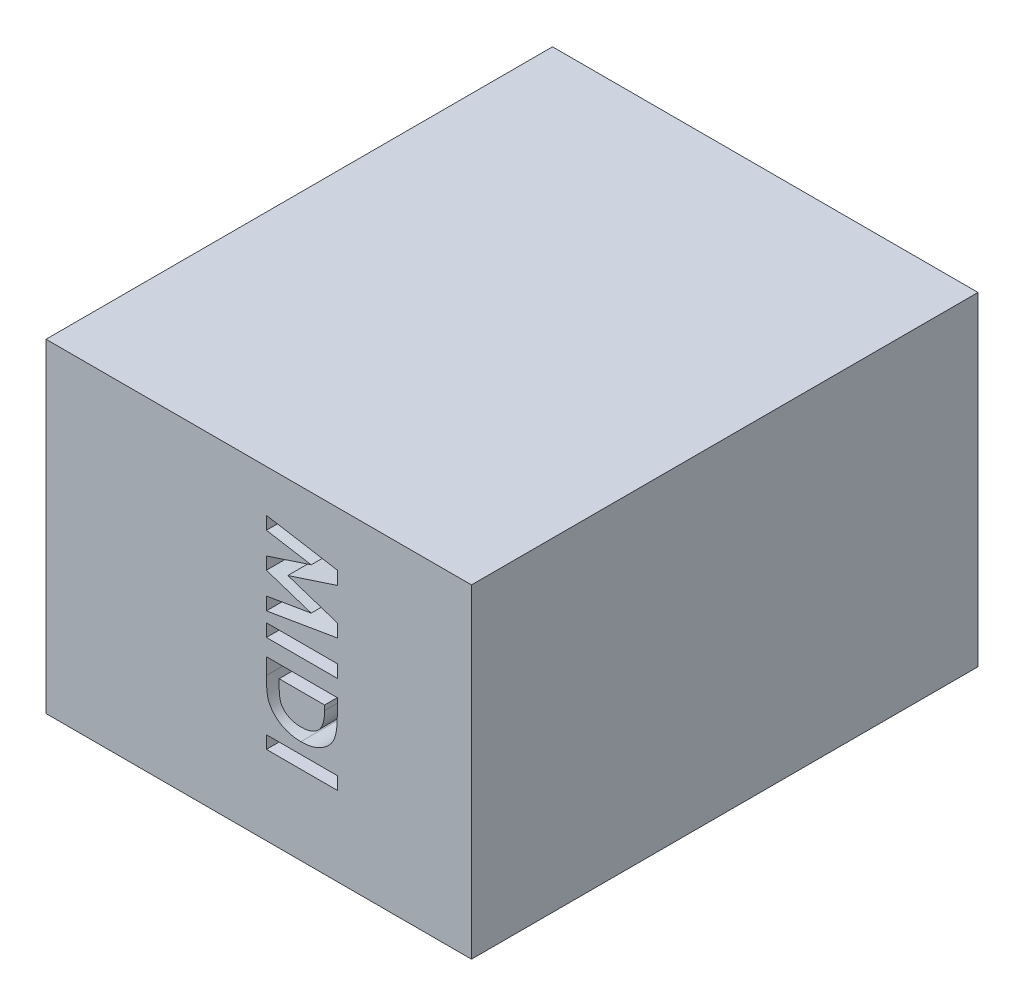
ISO-10303-21;
HEADER;
FILE_DESCRIPTION(('STEP AP214'),'2;1');
FILE_NAME('part.step','',(''),(''),'','','');
FILE_SCHEMA(('AUTOMOTIVE_DESIGN { 1 0 10303 214 1 1 1 1 }'));
ENDSEC;
DATA;
#1=APPLICATION_CONTEXT('core data for automotive mechanical design processes');
#2=APPLICATION_PROTOCOL_DEFINITION('international standard','automotive_design',2000,#1);
#3=PRODUCT_CONTEXT('',#1,'mechanical');
#4=PRODUCT('Part','Part','',(#3));
#5=PRODUCT_RELATED_PRODUCT_CATEGORY('part','',(#4));
#6=PRODUCT_DEFINITION_FORMATION('','',#4);
#7=PRODUCT_DEFINITION_CONTEXT('part definition',#1,'design');
#8=PRODUCT_DEFINITION('design','',#6,#7);
#9=PRODUCT_DEFINITION_SHAPE('','',#8);
#10=(LENGTH_UNIT() NAMED_UNIT(*) SI_UNIT(.MILLI.,.METRE.));
#11=(NAMED_UNIT(*) PLANE_ANGLE_UNIT() SI_UNIT($,.RADIAN.));
#12=(NAMED_UNIT(*) SI_UNIT($,.STERADIAN.) SOLID_ANGLE_UNIT());
#13=UNCERTAINTY_MEASURE_WITH_UNIT(LENGTH_MEASURE(1.E-05),#10,'distance_accuracy_value','');
#14=(GEOMETRIC_REPRESENTATION_CONTEXT(3) GLOBAL_UNCERTAINTY_ASSIGNED_CONTEXT((#13)) GLOBAL_UNIT_ASSIGNED_CONTEXT((#10,
#11,#12)) REPRESENTATION_CONTEXT('',''));
#15=CARTESIAN_POINT('',(0.,0.,0.));
#16=DIRECTION('',(0.,0.,1.));
#17=DIRECTION('',(1.,0.,0.));
#18=AXIS2_PLACEMENT_3D('',#15,#16,#17);
#19=CARTESIAN_POINT('',(0.,0.,25.));
#20=DIRECTION('',(0.,0.,1.));
#21=DIRECTION('',(1.,0.,0.));
#22=AXIS2_PLACEMENT_3D('',#19,#20,#21);
#23=PLANE('',#22);
#24=DIRECTION('',(0.,1.,0.));
#25=VECTOR('',#24,1.);
#26=CARTESIAN_POINT('',(-23.1795874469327,-5.25474592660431,25.));
#27=LINE('',#26,#25);
#28=CARTESIAN_POINT('',(-23.1795874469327,-5.25474592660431,25.));
#29=VERTEX_POINT('',#28);
#30=CARTESIAN_POINT('',(-23.1795874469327,-4.45126034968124,25.));
#31=VERTEX_POINT('',#30);
#32=EDGE_CURVE('E393',#29,#31,#27,.T.);
#33=ORIENTED_EDGE('',*,*,#32,.T.);
#34=DIRECTION('',(1.,0.,0.));
#35=VECTOR('',#34,1.);
#36=CARTESIAN_POINT('',(-23.1795874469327,-4.45126034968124,25.));
#37=LINE('',#36,#35);
#38=CARTESIAN_POINT('',(-19.6795874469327,-4.45126034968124,25.));
#39=VERTEX_POINT('',#38);
#40=EDGE_CURVE('E55',#31,#39,#37,.T.);
#41=ORIENTED_EDGE('',*,*,#40,.T.);
#42=DIRECTION('',(0.,-1.,0.));
#43=VECTOR('',#42,1.);
#44=CARTESIAN_POINT('',(-19.6795874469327,-4.45126034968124,25.));
#45=LINE('',#44,#43);
#46=CARTESIAN_POINT('',(-19.6795874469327,-5.24282685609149,25.));
#47=VERTEX_POINT('',#46);
#48=EDGE_CURVE('E376',#39,#47,#45,.T.);
#49=ORIENTED_EDGE('',*,*,#48,.T.);
#50=CARTESIAN_POINT('',(-19.6795874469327,-5.24282685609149,25.));
#51=CARTESIAN_POINT('',(-19.6800188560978,-5.30453856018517,25.));
#52=CARTESIAN_POINT('',(-19.6808527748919,-5.42382798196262,25.));
#53=CARTESIAN_POINT('',(-19.6902482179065,-5.59665491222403,25.));
#54=CARTESIAN_POINT('',(-19.7046992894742,-5.75736139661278,25.));
#55=CARTESIAN_POINT('',(-19.7245743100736,-5.90605355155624,25.));
#56=CARTESIAN_POINT('',(-19.7508910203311,-6.04241812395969,25.));
#57=CARTESIAN_POINT('',(-19.7838459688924,-6.16630715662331,25.));
#58=CARTESIAN_POINT('',(-19.8221315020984,-6.27824631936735,25.));
#59=CARTESIAN_POINT('',(-19.8666238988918,-6.37955051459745,25.));
#60=CARTESIAN_POINT('',(-19.91883117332,-6.4717746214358,25.));
#61=CARTESIAN_POINT('',(-19.9774770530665,-6.55872456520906,25.));
#62=CARTESIAN_POINT('',(-20.0434492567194,-6.64140269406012,25.));
#63=CARTESIAN_POINT('',(-20.1168992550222,-6.72026757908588,25.));
#64=CARTESIAN_POINT('',(-20.1973392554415,-6.7955113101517,25.));
#65=CARTESIAN_POINT('',(-20.2863888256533,-6.86536763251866,25.));
#66=CARTESIAN_POINT('',(-20.3817415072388,-6.93207608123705,25.));
#67=CARTESIAN_POINT('',(-20.4837282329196,-6.99455430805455,25.));
#68=CARTESIAN_POINT('',(-20.5921476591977,-7.05016773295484,25.));
#69=CARTESIAN_POINT('',(-20.7052933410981,-7.09966991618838,25.));
#70=CARTESIAN_POINT('',(-20.8232388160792,-7.14091417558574,25.));
#71=CARTESIAN_POINT('',(-20.9458212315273,-7.17449671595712,25.));
#72=CARTESIAN_POINT('',(-21.0726854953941,-7.20124706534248,25.));
#73=CARTESIAN_POINT('',(-21.2040733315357,-7.21996847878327,25.));
#74=CARTESIAN_POINT('',(-21.3398670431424,-7.23154104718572,25.));
#75=CARTESIAN_POINT('',(-21.4319009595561,-7.23271507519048,25.));
#76=CARTESIAN_POINT('',(-21.4786659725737,-7.23331163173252,25.));
#77=B_SPLINE_CURVE_WITH_KNOTS('',3,(#50,#51,#52,#53,#54,#55,#56,#57,#58,#59,#60,#61,#62,#63,#64,
#65,#66,#67,#68,#69,#70,#71,#72,#73,#74,#75,#76),.UNSPECIFIED.,.F.,.F.,(4,1,1,1,1,1,1,1,1,1,1,1,
1,1,1,1,1,1,1,1,1,1,1,1,4),(0.,0.0601447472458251,0.116260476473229,0.168644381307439,
0.217386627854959,0.262418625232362,0.303915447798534,0.34224053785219,0.3776280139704,
0.411590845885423,0.445392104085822,0.479758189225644,0.514574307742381,0.550356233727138,
0.586999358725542,0.624789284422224,0.663739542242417,0.703473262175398,0.743464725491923,
0.784025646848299,0.82514246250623,0.867272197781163,0.910311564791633,0.954426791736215,1.),.UNSPECIFIED.);
#78=CARTESIAN_POINT('',(-21.4786659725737,-7.23331163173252,25.));
#79=VERTEX_POINT('',#78);
#80=EDGE_CURVE('E380',#47,#79,#77,.T.);
#81=ORIENTED_EDGE('',*,*,#80,.T.);
#82=CARTESIAN_POINT('',(-21.4786659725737,-7.23331163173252,25.));
#83=CARTESIAN_POINT('',(-21.5446545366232,-7.23174968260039,25.));
#84=CARTESIAN_POINT('',(-21.6745568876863,-7.22867489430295,25.));
#85=CARTESIAN_POINT('',(-21.8651859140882,-7.20277179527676,25.));
#86=CARTESIAN_POINT('',(-22.0479273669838,-7.16088454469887,25.));
#87=CARTESIAN_POINT('',(-22.22133067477,-7.10196342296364,25.));
#88=CARTESIAN_POINT('',(-22.3839275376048,-7.02899976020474,25.));
#89=CARTESIAN_POINT('',(-22.5324608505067,-6.94161676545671,25.));
#90=CARTESIAN_POINT('',(-22.6672334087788,-6.84232457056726,25.));
#91=CARTESIAN_POINT('',(-22.7860089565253,-6.73024206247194,25.));
#92=CARTESIAN_POINT('',(-22.8887234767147,-6.60907570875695,25.));
#93=CARTESIAN_POINT('',(-22.9756652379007,-6.48266612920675,25.));
#94=CARTESIAN_POINT('',(-23.0454552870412,-6.35112688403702,25.));
#95=CARTESIAN_POINT('',(-23.0890268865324,-6.23497715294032,25.));
#96=CARTESIAN_POINT('',(-23.1164367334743,-6.1339799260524,25.));
#97=CARTESIAN_POINT('',(-23.1322750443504,-6.04542738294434,25.));
#98=CARTESIAN_POINT('',(-23.1473617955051,-5.94471418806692,25.));
#99=CARTESIAN_POINT('',(-23.1585672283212,-5.8311926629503,25.));
#100=CARTESIAN_POINT('',(-23.1688377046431,-5.70501002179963,25.));
#101=CARTESIAN_POINT('',(-23.174349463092,-5.56607896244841,25.));
#102=CARTESIAN_POINT('',(-23.1789528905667,-5.41463249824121,25.));
#103=CARTESIAN_POINT('',(-23.1793703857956,-5.30943793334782,25.));
#104=CARTESIAN_POINT('',(-23.1795874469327,-5.25474592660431,25.));
#105=B_SPLINE_CURVE_WITH_KNOTS('',3,(#82,#83,#84,#85,#86,#87,#88,#89,#90,#91,#92,#93,#94,#95,
#96,#97,#98,#99,#100,#101,#102,#103,#104),.UNSPECIFIED.,.F.,.F.,(4,1,1,1,1,1,1,1,1,1,1,1,1,1,1,
1,1,1,1,1,4),(0.,0.0657678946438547,0.129467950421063,0.191415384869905,0.252426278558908,
0.31176301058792,0.368789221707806,0.42391976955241,0.478316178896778,0.53121375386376,
0.582012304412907,0.630999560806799,0.679297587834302,0.705353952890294,0.735240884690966,
0.768918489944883,0.806873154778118,0.848941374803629,0.895124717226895,0.945473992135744,1.),.UNSPECIFIED.);
#106=EDGE_CURVE('E385',#79,#29,#105,.T.);
#107=ORIENTED_EDGE('',*,*,#106,.T.);
#108=EDGE_LOOP('',(#33,#41,#49,#81,#107));
#109=FACE_BOUND('',#108,.T.);
#110=DIRECTION('',(0.,1.,0.));
#111=VECTOR('',#110,1.);
#112=CARTESIAN_POINT('',(-23.1795874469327,0.953134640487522,25.));
#113=LINE('',#112,#111);
#114=CARTESIAN_POINT('',(-23.1795874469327,0.953134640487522,25.));
#115=VERTEX_POINT('',#114);
#116=CARTESIAN_POINT('',(-23.1795874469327,1.58975323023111,25.));
#117=VERTEX_POINT('',#116);
#118=EDGE_CURVE('E445',#115,#117,#113,.T.);
#119=ORIENTED_EDGE('',*,*,#118,.T.);
#120=DIRECTION('',(0.986039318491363,-0.166512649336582,0.));
#121=VECTOR('',#120,1.);
#122=CARTESIAN_POINT('',(-23.1795874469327,1.58975323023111,25.));
#123=LINE('',#122,#121);
#124=CARTESIAN_POINT('',(-19.6795874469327,0.998707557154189,25.));
#125=VERTEX_POINT('',#124);
#126=EDGE_CURVE('E440',#117,#125,#123,.T.);
#127=ORIENTED_EDGE('',*,*,#126,.T.);
#128=DIRECTION('',(0.,-1.,0.));
#129=VECTOR('',#128,1.);
#130=CARTESIAN_POINT('',(-19.6795874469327,0.998707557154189,25.));
#131=LINE('',#130,#129);
#132=CARTESIAN_POINT('',(-19.6795874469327,0.34666428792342,25.));
#133=VERTEX_POINT('',#132);
#134=EDGE_CURVE('E472',#125,#133,#131,.T.);
#135=ORIENTED_EDGE('',*,*,#134,.T.);
#136=DIRECTION('',(-0.950442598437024,-0.310900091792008,0.));
#137=VECTOR('',#136,1.);
#138=CARTESIAN_POINT('',(-19.6795874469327,0.34666428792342,25.));
#139=LINE('',#138,#137);
#140=CARTESIAN_POINT('',(-22.1208935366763,-0.451913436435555,25.));
#141=VERTEX_POINT('',#140);
#142=EDGE_CURVE('E475',#133,#141,#139,.T.);
#143=ORIENTED_EDGE('',*,*,#142,.T.);
#144=DIRECTION('',(0.949795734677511,-0.312870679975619,0.));
#145=VECTOR('',#144,1.);
#146=CARTESIAN_POINT('',(-22.1208935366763,-0.451913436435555,25.));
#147=LINE('',#146,#145);
#148=CARTESIAN_POINT('',(-19.6795874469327,-1.2561001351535,25.));
#149=VERTEX_POINT('',#148);
#150=EDGE_CURVE('E478',#141,#149,#147,.T.);
#151=ORIENTED_EDGE('',*,*,#150,.T.);
#152=DIRECTION('',(0.,-1.,0.));
#153=VECTOR('',#152,1.);
#154=CARTESIAN_POINT('',(-19.6795874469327,-1.2561001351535,25.));
#155=LINE('',#154,#153);
#156=CARTESIAN_POINT('',(-19.6795874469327,-1.90183330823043,25.));
#157=VERTEX_POINT('',#156);
#158=EDGE_CURVE('E481',#149,#157,#155,.T.);
#159=ORIENTED_EDGE('',*,*,#158,.T.);
#160=DIRECTION('',(-0.98600686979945,-0.166704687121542,0.));
#161=VECTOR('',#160,1.);
#162=CARTESIAN_POINT('',(-19.6795874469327,-1.90183330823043,25.));
#163=LINE('',#162,#161);
#164=CARTESIAN_POINT('',(-23.1795874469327,-2.49358010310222,25.));
#165=VERTEX_POINT('',#164);
#166=EDGE_CURVE('E484',#157,#165,#163,.T.);
#167=ORIENTED_EDGE('',*,*,#166,.T.);
#168=DIRECTION('',(0.,1.,0.));
#169=VECTOR('',#168,1.);
#170=CARTESIAN_POINT('',(-23.1795874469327,-2.49358010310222,25.));
#171=LINE('',#170,#169);
#172=CARTESIAN_POINT('',(-23.1795874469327,-1.8576626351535,25.));
#173=VERTEX_POINT('',#172);
#174=EDGE_CURVE('E487',#165,#173,#171,.T.);
#175=ORIENTED_EDGE('',*,*,#174,.T.);
#176=DIRECTION('',(0.986010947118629,0.166680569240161,0.));
#177=VECTOR('',#176,1.);
#178=CARTESIAN_POINT('',(-23.1795874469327,-1.8576626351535,25.));
#179=LINE('',#178,#177);
#180=CARTESIAN_POINT('',(-20.9689504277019,-1.48396471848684,25.));
#181=VERTEX_POINT('',#180);
#182=EDGE_CURVE('E490',#173,#181,#179,.T.);
#183=ORIENTED_EDGE('',*,*,#182,.T.);
#184=DIRECTION('',(-0.949851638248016,0.312700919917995,0.));
#185=VECTOR('',#184,1.);
#186=CARTESIAN_POINT('',(-20.9689504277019,-1.48396471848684,25.));
#187=LINE('',#186,#185);
#188=CARTESIAN_POINT('',(-23.1795874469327,-0.756200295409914,25.));
#189=VERTEX_POINT('',#188);
#190=EDGE_CURVE('E493',#181,#189,#187,.T.);
#191=ORIENTED_EDGE('',*,*,#190,.T.);
#192=DIRECTION('',(0.,1.,0.));
#193=VECTOR('',#192,1.);
#194=CARTESIAN_POINT('',(-23.1795874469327,-0.756200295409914,25.));
#195=LINE('',#194,#193);
#196=CARTESIAN_POINT('',(-23.1795874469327,-0.143419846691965,25.));
#197=VERTEX_POINT('',#196);
#198=EDGE_CURVE('E496',#189,#197,#195,.T.);
#199=ORIENTED_EDGE('',*,*,#198,.T.);
#200=DIRECTION('',(0.950387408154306,0.311068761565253,0.));
#201=VECTOR('',#200,1.);
#202=CARTESIAN_POINT('',(-23.1795874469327,-0.143419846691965,25.));
#203=LINE('',#202,#201);
#204=CARTESIAN_POINT('',(-20.9689504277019,0.580137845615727,25.));
#205=VERTEX_POINT('',#204);
#206=EDGE_CURVE('E499',#197,#205,#203,.T.);
#207=ORIENTED_EDGE('',*,*,#206,.T.);
#208=DIRECTION('',(-0.986062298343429,0.166376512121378,0.));
#209=VECTOR('',#208,1.);
#210=CARTESIAN_POINT('',(-20.9689504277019,0.580137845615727,25.));
#211=LINE('',#210,#209);
#212=EDGE_CURVE('E502',#205,#115,#211,.T.);
#213=ORIENTED_EDGE('',*,*,#212,.T.);
#214=EDGE_LOOP('',(#119,#127,#135,#143,#151,#159,#167,#175,#183,#191,#199,#207,#213));
#215=FACE_BOUND('',#214,.T.);
#216=DIRECTION('',(0.,-1.,0.));
#217=VECTOR('',#216,1.);
#218=CARTESIAN_POINT('',(-34.0568963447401,3.67862010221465,25.));
#219=LINE('',#218,#217);
#220=CARTESIAN_POINT('',(-34.0568963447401,3.67862010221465,25.));
#221=VERTEX_POINT('',#220);
#222=CARTESIAN_POINT('',(-34.0568963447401,-12.3213798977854,25.));
#223=VERTEX_POINT('',#222);
#224=EDGE_CURVE('E535',#221,#223,#219,.T.);
#225=ORIENTED_EDGE('',*,*,#224,.T.);
#226=DIRECTION('',(1.,0.,0.));
#227=VECTOR('',#226,1.);
#228=CARTESIAN_POINT('',(-34.0568963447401,-12.3213798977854,25.));
#229=LINE('',#228,#227);
#230=CARTESIAN_POINT('',(-13.0568963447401,-12.3213798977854,25.));
#231=VERTEX_POINT('',#230);
#232=EDGE_CURVE('E538',#223,#231,#229,.T.);
#233=ORIENTED_EDGE('',*,*,#232,.T.);
#234=DIRECTION('',(0.,1.,0.));
#235=VECTOR('',#234,1.);
#236=CARTESIAN_POINT('',(-13.0568963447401,3.67862010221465,25.));
#237=LINE('',#236,#235);
#238=CARTESIAN_POINT('',(-13.0568963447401,3.67862010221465,25.));
#239=VERTEX_POINT('',#238);
#240=EDGE_CURVE('E541',#231,#239,#237,.T.);
#241=ORIENTED_EDGE('',*,*,#240,.T.);
#242=DIRECTION('',(-1.,0.,0.));
#243=VECTOR('',#242,1.);
#244=CARTESIAN_POINT('',(-34.0568963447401,3.67862010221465,25.));
#245=LINE('',#244,#243);
#246=EDGE_CURVE('E543',#239,#221,#245,.T.);
#247=ORIENTED_EDGE('',*,*,#246,.T.);
#248=EDGE_LOOP('',(#225,#233,#241,#247));
#249=FACE_BOUND('',#248,.T.);
#250=DIRECTION('',(0.,1.,0.));
#251=VECTOR('',#250,1.);
#252=CARTESIAN_POINT('',(-23.1795874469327,-3.62947150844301,25.));
#253=LINE('',#252,#251);
#254=CARTESIAN_POINT('',(-23.1795874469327,-3.62947150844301,25.));
#255=VERTEX_POINT('',#254);
#256=CARTESIAN_POINT('',(-23.1795874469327,-3.00126638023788,25.));
#257=VERTEX_POINT('',#256);
#258=EDGE_CURVE('E414',#255,#257,#253,.T.);
#259=ORIENTED_EDGE('',*,*,#258,.T.);
#260=DIRECTION('',(1.,0.,0.));
#261=VECTOR('',#260,1.);
#262=CARTESIAN_POINT('',(-23.1795874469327,-3.00126638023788,25.));
#263=LINE('',#262,#261);
#264=CARTESIAN_POINT('',(-19.6795874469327,-3.00126638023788,25.));
#265=VERTEX_POINT('',#264);
#266=EDGE_CURVE('E409',#257,#265,#263,.T.);
#267=ORIENTED_EDGE('',*,*,#266,.T.);
#268=DIRECTION('',(0.,-1.,0.));
#269=VECTOR('',#268,1.);
#270=CARTESIAN_POINT('',(-19.6795874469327,-3.00126638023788,25.));
#271=LINE('',#270,#269);
#272=CARTESIAN_POINT('',(-19.6795874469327,-3.62947150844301,25.));
#273=VERTEX_POINT('',#272);
#274=EDGE_CURVE('E423',#265,#273,#271,.T.);
#275=ORIENTED_EDGE('',*,*,#274,.T.);
#276=DIRECTION('',(-1.,0.,0.));
#277=VECTOR('',#276,1.);
#278=CARTESIAN_POINT('',(-19.6795874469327,-3.62947150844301,25.));
#279=LINE('',#278,#277);
#280=EDGE_CURVE('E426',#273,#255,#279,.T.);
#281=ORIENTED_EDGE('',*,*,#280,.T.);
#282=EDGE_LOOP('',(#259,#267,#275,#281));
#283=FACE_BOUND('',#282,.T.);
#284=DIRECTION('',(0.,1.,0.));
#285=VECTOR('',#284,1.);
#286=CARTESIAN_POINT('',(-23.1795874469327,-8.41407483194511,25.));
#287=LINE('',#286,#285);
#288=CARTESIAN_POINT('',(-23.1795874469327,-8.41407483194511,25.));
#289=VERTEX_POINT('',#288);
#290=CARTESIAN_POINT('',(-23.1795874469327,-7.78586970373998,25.));
#291=VERTEX_POINT('',#290);
#292=EDGE_CURVE('E282',#289,#291,#287,.T.);
#293=ORIENTED_EDGE('',*,*,#292,.T.);
#294=DIRECTION('',(1.,0.,0.));
#295=VECTOR('',#294,1.);
#296=CARTESIAN_POINT('',(-23.1795874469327,-7.78586970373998,25.));
#297=LINE('',#296,#295);
#298=CARTESIAN_POINT('',(-19.6795874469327,-7.78586970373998,25.));
#299=VERTEX_POINT('',#298);
#300=EDGE_CURVE('E47',#291,#299,#297,.T.);
#301=ORIENTED_EDGE('',*,*,#300,.T.);
#302=DIRECTION('',(0.,-1.,0.));
#303=VECTOR('',#302,1.);
#304=CARTESIAN_POINT('',(-19.6795874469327,-7.78586970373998,25.));
#305=LINE('',#304,#303);
#306=CARTESIAN_POINT('',(-19.6795874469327,-8.41407483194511,25.));
#307=VERTEX_POINT('',#306);
#308=EDGE_CURVE('E286',#299,#307,#305,.T.);
#309=ORIENTED_EDGE('',*,*,#308,.T.);
#310=DIRECTION('',(-1.,0.,0.));
#311=VECTOR('',#310,1.);
#312=CARTESIAN_POINT('',(-19.6795874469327,-8.41407483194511,25.));
#313=LINE('',#312,#311);
#314=EDGE_CURVE('E1037',#307,#289,#313,.T.);
#315=ORIENTED_EDGE('',*,*,#314,.T.);
#316=EDGE_LOOP('',(#293,#301,#309,#315));
#317=FACE_BOUND('',#316,.T.);
#318=ADVANCED_FACE('F32',(#109,#215,#249,#283,#317),#23,.T.);
#319=CARTESIAN_POINT('',(-34.0568963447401,3.67862010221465,25.));
#320=DIRECTION('',(1.,0.,0.));
#321=DIRECTION('',(0.,1.,0.));
#322=AXIS2_PLACEMENT_3D('',#319,#320,#321);
#323=PLANE('',#322);
#324=DIRECTION('',(0.,-1.,0.));
#325=VECTOR('',#324,1.);
#326=CARTESIAN_POINT('',(-34.0568963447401,3.67862010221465,0.));
#327=LINE('',#326,#325);
#328=CARTESIAN_POINT('',(-34.0568963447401,3.67862010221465,0.));
#329=VERTEX_POINT('',#328);
#330=CARTESIAN_POINT('',(-34.0568963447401,-12.3213798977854,0.));
#331=VERTEX_POINT('',#330);
#332=EDGE_CURVE('E534',#329,#331,#327,.T.);
#333=ORIENTED_EDGE('',*,*,#332,.T.);
#334=DIRECTION('',(0.,0.,-1.));
#335=VECTOR('',#334,1.);
#336=CARTESIAN_POINT('',(-34.0568963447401,-12.3213798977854,25.));
#337=LINE('',#336,#335);
#338=EDGE_CURVE('E11',#223,#331,#337,.T.);
#339=ORIENTED_EDGE('',*,*,#338,.F.);
#340=ORIENTED_EDGE('',*,*,#224,.F.);
#341=DIRECTION('',(0.,0.,-1.));
#342=VECTOR('',#341,1.);
#343=CARTESIAN_POINT('',(-34.0568963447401,3.67862010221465,25.));
#344=LINE('',#343,#342);
#345=EDGE_CURVE('E545',#221,#329,#344,.T.);
#346=ORIENTED_EDGE('',*,*,#345,.T.);
#347=EDGE_LOOP('',(#333,#339,#340,#346));
#348=FACE_BOUND('',#347,.T.);
#349=ADVANCED_FACE('F34',(#348),#323,.F.);
#350=CARTESIAN_POINT('',(-34.0568963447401,-12.3213798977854,25.));
#351=DIRECTION('',(0.,1.,0.));
#352=DIRECTION('',(0.,0.,1.));
#353=AXIS2_PLACEMENT_3D('',#350,#351,#352);
#354=PLANE('',#353);
#355=DIRECTION('',(1.,0.,0.));
#356=VECTOR('',#355,1.);
#357=CARTESIAN_POINT('',(-34.0568963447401,-12.3213798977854,0.));
#358=LINE('',#357,#356);
#359=CARTESIAN_POINT('',(-13.0568963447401,-12.3213798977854,0.));
#360=VERTEX_POINT('',#359);
#361=EDGE_CURVE('E548',#331,#360,#358,.T.);
#362=ORIENTED_EDGE('',*,*,#361,.T.);
#363=DIRECTION('',(0.,0.,-1.));
#364=VECTOR('',#363,1.);
#365=CARTESIAN_POINT('',(-13.0568963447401,-12.3213798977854,25.));
#366=LINE('',#365,#364);
#367=EDGE_CURVE('E40',#231,#360,#366,.T.);
#368=ORIENTED_EDGE('',*,*,#367,.F.);
#369=ORIENTED_EDGE('',*,*,#232,.F.);
#370=ORIENTED_EDGE('',*,*,#338,.T.);
#371=EDGE_LOOP('',(#362,#368,#369,#370));
#372=FACE_BOUND('',#371,.T.);
#373=ADVANCED_FACE('F578',(#372),#354,.F.);
#374=CARTESIAN_POINT('',(-13.0568963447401,3.67862010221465,25.));
#375=DIRECTION('',(-1.,0.,0.));
#376=DIRECTION('',(0.,0.,1.));
#377=AXIS2_PLACEMENT_3D('',#374,#375,#376);
#378=PLANE('',#377);
#379=DIRECTION('',(0.,1.,0.));
#380=VECTOR('',#379,1.);
#381=CARTESIAN_POINT('',(-13.0568963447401,3.67862010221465,0.));
#382=LINE('',#381,#380);
#383=CARTESIAN_POINT('',(-13.0568963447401,3.67862010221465,0.));
#384=VERTEX_POINT('',#383);
#385=EDGE_CURVE('E550',#360,#384,#382,.T.);
#386=ORIENTED_EDGE('',*,*,#385,.T.);
#387=DIRECTION('',(0.,0.,-1.));
#388=VECTOR('',#387,1.);
#389=CARTESIAN_POINT('',(-13.0568963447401,3.67862010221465,25.));
#390=LINE('',#389,#388);
#391=EDGE_CURVE('E555',#239,#384,#390,.T.);
#392=ORIENTED_EDGE('',*,*,#391,.F.);
#393=ORIENTED_EDGE('',*,*,#240,.F.);
#394=ORIENTED_EDGE('',*,*,#367,.T.);
#395=EDGE_LOOP('',(#386,#392,#393,#394));
#396=FACE_BOUND('',#395,.T.);
#397=ADVANCED_FACE('F562',(#396),#378,.F.);
#398=CARTESIAN_POINT('',(-34.0568963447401,3.67862010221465,25.));
#399=DIRECTION('',(0.,-1.,0.));
#400=DIRECTION('',(0.,0.,-1.));
#401=AXIS2_PLACEMENT_3D('',#398,#399,#400);
#402=PLANE('',#401);
#403=DIRECTION('',(-1.,0.,0.));
#404=VECTOR('',#403,1.);
#405=CARTESIAN_POINT('',(-34.0568963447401,3.67862010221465,0.));
#406=LINE('',#405,#404);
#407=EDGE_CURVE('E539',#384,#329,#406,.T.);
#408=ORIENTED_EDGE('',*,*,#407,.T.);
#409=ORIENTED_EDGE('',*,*,#345,.F.);
#410=ORIENTED_EDGE('',*,*,#246,.F.);
#411=ORIENTED_EDGE('',*,*,#391,.T.);
#412=EDGE_LOOP('',(#408,#409,#410,#411));
#413=FACE_BOUND('',#412,.T.);
#414=ADVANCED_FACE('F571',(#413),#402,.F.);
#415=CARTESIAN_POINT('',(0.,0.,0.));
#416=DIRECTION('',(0.,0.,1.));
#417=DIRECTION('',(1.,0.,0.));
#418=AXIS2_PLACEMENT_3D('',#415,#416,#417);
#419=PLANE('',#418);
#420=ORIENTED_EDGE('',*,*,#332,.F.);
#421=ORIENTED_EDGE('',*,*,#407,.F.);
#422=ORIENTED_EDGE('',*,*,#385,.F.);
#423=ORIENTED_EDGE('',*,*,#361,.F.);
#424=EDGE_LOOP('',(#420,#421,#422,#423));
#425=FACE_BOUND('',#424,.T.);
#426=ADVANCED_FACE('F568',(#425),#419,.F.);
#427=CARTESIAN_POINT('',(-23.1795874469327,1.58975323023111,20.3445977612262));
#428=DIRECTION('',(-0.166512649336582,-0.986039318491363,0.));
#429=DIRECTION('',(0.986039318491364,-0.166512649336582,0.));
#430=AXIS2_PLACEMENT_3D('',#427,#428,#429);
#431=PLANE('',#430);
#432=ORIENTED_EDGE('',*,*,#126,.F.);
#433=DIRECTION('',(0.,0.,1.));
#434=VECTOR('',#433,1.);
#435=CARTESIAN_POINT('',(-23.1795874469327,1.58975323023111,20.3445977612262));
#436=LINE('',#435,#434);
#437=CARTESIAN_POINT('',(-23.1795874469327,1.58975323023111,20.3445977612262));
#438=VERTEX_POINT('',#437);
#439=EDGE_CURVE('E469',#438,#117,#436,.T.);
#440=ORIENTED_EDGE('',*,*,#439,.F.);
#441=DIRECTION('',(0.986039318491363,-0.166512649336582,0.));
#442=VECTOR('',#441,1.);
#443=CARTESIAN_POINT('',(-23.1795874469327,1.58975323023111,20.3445977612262));
#444=LINE('',#443,#442);
#445=CARTESIAN_POINT('',(-19.6795874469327,0.998707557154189,20.3445977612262));
#446=VERTEX_POINT('',#445);
#447=EDGE_CURVE('E441',#438,#446,#444,.T.);
#448=ORIENTED_EDGE('',*,*,#447,.T.);
#449=DIRECTION('',(0.,0.,1.));
#450=VECTOR('',#449,1.);
#451=CARTESIAN_POINT('',(-19.6795874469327,0.998707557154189,20.3445977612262));
#452=LINE('',#451,#450);
#453=EDGE_CURVE('E531',#446,#125,#452,.T.);
#454=ORIENTED_EDGE('',*,*,#453,.T.);
#455=EDGE_LOOP('',(#432,#440,#448,#454));
#456=FACE_BOUND('',#455,.T.);
#457=ADVANCED_FACE('F728',(#456),#431,.T.);
#458=CARTESIAN_POINT('',(-19.6795874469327,0.998707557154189,20.3445977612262));
#459=DIRECTION('',(-1.,0.,0.));
#460=DIRECTION('',(0.,0.,1.));
#461=AXIS2_PLACEMENT_3D('',#458,#459,#460);
#462=PLANE('',#461);
#463=ORIENTED_EDGE('',*,*,#134,.F.);
#464=ORIENTED_EDGE('',*,*,#453,.F.);
#465=DIRECTION('',(0.,-1.,0.));
#466=VECTOR('',#465,1.);
#467=CARTESIAN_POINT('',(-19.6795874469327,0.998707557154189,20.3445977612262));
#468=LINE('',#467,#466);
#469=CARTESIAN_POINT('',(-19.6795874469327,0.34666428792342,20.3445977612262));
#470=VERTEX_POINT('',#469);
#471=EDGE_CURVE('E444',#446,#470,#468,.T.);
#472=ORIENTED_EDGE('',*,*,#471,.T.);
#473=DIRECTION('',(0.,0.,1.));
#474=VECTOR('',#473,1.);
#475=CARTESIAN_POINT('',(-19.6795874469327,0.34666428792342,20.3445977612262));
#476=LINE('',#475,#474);
#477=EDGE_CURVE('E529',#470,#133,#476,.T.);
#478=ORIENTED_EDGE('',*,*,#477,.T.);
#479=EDGE_LOOP('',(#463,#464,#472,#478));
#480=FACE_BOUND('',#479,.T.);
#481=ADVANCED_FACE('F725',(#480),#462,.T.);
#482=CARTESIAN_POINT('',(-19.6795874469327,0.34666428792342,20.3445977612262));
#483=DIRECTION('',(-0.310900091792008,0.950442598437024,0.));
#484=DIRECTION('',(-0.950442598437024,-0.310900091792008,0.));
#485=AXIS2_PLACEMENT_3D('',#482,#483,#484);
#486=PLANE('',#485);
#487=ORIENTED_EDGE('',*,*,#142,.F.);
#488=ORIENTED_EDGE('',*,*,#477,.F.);
#489=DIRECTION('',(-0.950442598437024,-0.310900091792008,0.));
#490=VECTOR('',#489,1.);
#491=CARTESIAN_POINT('',(-19.6795874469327,0.34666428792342,20.3445977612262));
#492=LINE('',#491,#490);
#493=CARTESIAN_POINT('',(-22.1208935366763,-0.451913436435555,20.3445977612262));
#494=VERTEX_POINT('',#493);
#495=EDGE_CURVE('E447',#470,#494,#492,.T.);
#496=ORIENTED_EDGE('',*,*,#495,.T.);
#497=DIRECTION('',(0.,0.,1.));
#498=VECTOR('',#497,1.);
#499=CARTESIAN_POINT('',(-22.1208935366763,-0.451913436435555,20.3445977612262));
#500=LINE('',#499,#498);
#501=EDGE_CURVE('E527',#494,#141,#500,.T.);
#502=ORIENTED_EDGE('',*,*,#501,.T.);
#503=EDGE_LOOP('',(#487,#488,#496,#502));
#504=FACE_BOUND('',#503,.T.);
#505=ADVANCED_FACE('F721',(#504),#486,.T.);
#506=CARTESIAN_POINT('',(-22.1208935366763,-0.451913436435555,20.3445977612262));
#507=DIRECTION('',(-0.312870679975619,-0.949795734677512,0.));
#508=DIRECTION('',(0.949795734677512,-0.312870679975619,0.));
#509=AXIS2_PLACEMENT_3D('',#506,#507,#508);
#510=PLANE('',#509);
#511=ORIENTED_EDGE('',*,*,#150,.F.);
#512=ORIENTED_EDGE('',*,*,#501,.F.);
#513=DIRECTION('',(0.949795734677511,-0.312870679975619,0.));
#514=VECTOR('',#513,1.);
#515=CARTESIAN_POINT('',(-22.1208935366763,-0.451913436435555,20.3445977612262));
#516=LINE('',#515,#514);
#517=CARTESIAN_POINT('',(-19.6795874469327,-1.2561001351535,20.3445977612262));
#518=VERTEX_POINT('',#517);
#519=EDGE_CURVE('E449',#494,#518,#516,.T.);
#520=ORIENTED_EDGE('',*,*,#519,.T.);
#521=DIRECTION('',(0.,0.,1.));
#522=VECTOR('',#521,1.);
#523=CARTESIAN_POINT('',(-19.6795874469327,-1.2561001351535,20.3445977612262));
#524=LINE('',#523,#522);
#525=EDGE_CURVE('E525',#518,#149,#524,.T.);
#526=ORIENTED_EDGE('',*,*,#525,.T.);
#527=EDGE_LOOP('',(#511,#512,#520,#526));
#528=FACE_BOUND('',#527,.T.);
#529=ADVANCED_FACE('F717',(#528),#510,.T.);
#530=CARTESIAN_POINT('',(-19.6795874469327,-1.2561001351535,20.3445977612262));
#531=DIRECTION('',(-1.,0.,0.));
#532=DIRECTION('',(0.,0.,1.));
#533=AXIS2_PLACEMENT_3D('',#530,#531,#532);
#534=PLANE('',#533);
#535=ORIENTED_EDGE('',*,*,#158,.F.);
#536=ORIENTED_EDGE('',*,*,#525,.F.);
#537=DIRECTION('',(0.,-1.,0.));
#538=VECTOR('',#537,1.);
#539=CARTESIAN_POINT('',(-19.6795874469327,-1.2561001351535,20.3445977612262));
#540=LINE('',#539,#538);
#541=CARTESIAN_POINT('',(-19.6795874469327,-1.90183330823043,20.3445977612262));
#542=VERTEX_POINT('',#541);
#543=EDGE_CURVE('E451',#518,#542,#540,.T.);
#544=ORIENTED_EDGE('',*,*,#543,.T.);
#545=DIRECTION('',(0.,0.,1.));
#546=VECTOR('',#545,1.);
#547=CARTESIAN_POINT('',(-19.6795874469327,-1.90183330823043,20.3445977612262));
#548=LINE('',#547,#546);
#549=EDGE_CURVE('E523',#542,#157,#548,.T.);
#550=ORIENTED_EDGE('',*,*,#549,.T.);
#551=EDGE_LOOP('',(#535,#536,#544,#550));
#552=FACE_BOUND('',#551,.T.);
#553=ADVANCED_FACE('F713',(#552),#534,.T.);
#554=CARTESIAN_POINT('',(-19.6795874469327,-1.90183330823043,20.3445977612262));
#555=DIRECTION('',(-0.166704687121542,0.98600686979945,0.));
#556=DIRECTION('',(-0.98600686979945,-0.166704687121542,0.));
#557=AXIS2_PLACEMENT_3D('',#554,#555,#556);
#558=PLANE('',#557);
#559=ORIENTED_EDGE('',*,*,#166,.F.);
#560=ORIENTED_EDGE('',*,*,#549,.F.);
#561=DIRECTION('',(-0.98600686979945,-0.166704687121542,0.));
#562=VECTOR('',#561,1.);
#563=CARTESIAN_POINT('',(-19.6795874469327,-1.90183330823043,20.3445977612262));
#564=LINE('',#563,#562);
#565=CARTESIAN_POINT('',(-23.1795874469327,-2.49358010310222,20.3445977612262));
#566=VERTEX_POINT('',#565);
#567=EDGE_CURVE('E453',#542,#566,#564,.T.);
#568=ORIENTED_EDGE('',*,*,#567,.T.);
#569=DIRECTION('',(0.,0.,1.));
#570=VECTOR('',#569,1.);
#571=CARTESIAN_POINT('',(-23.1795874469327,-2.49358010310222,20.3445977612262));
#572=LINE('',#571,#570);
#573=EDGE_CURVE('E521',#566,#165,#572,.T.);
#574=ORIENTED_EDGE('',*,*,#573,.T.);
#575=EDGE_LOOP('',(#559,#560,#568,#574));
#576=FACE_BOUND('',#575,.T.);
#577=ADVANCED_FACE('F709',(#576),#558,.T.);
#578=CARTESIAN_POINT('',(-23.1795874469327,-2.49358010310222,20.3445977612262));
#579=DIRECTION('',(1.,0.,0.));
#580=DIRECTION('',(0.,0.,-1.));
#581=AXIS2_PLACEMENT_3D('',#578,#579,#580);
#582=PLANE('',#581);
#583=ORIENTED_EDGE('',*,*,#174,.F.);
#584=ORIENTED_EDGE('',*,*,#573,.F.);
#585=DIRECTION('',(0.,1.,0.));
#586=VECTOR('',#585,1.);
#587=CARTESIAN_POINT('',(-23.1795874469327,-2.49358010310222,20.3445977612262));
#588=LINE('',#587,#586);
#589=CARTESIAN_POINT('',(-23.1795874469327,-1.8576626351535,20.3445977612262));
#590=VERTEX_POINT('',#589);
#591=EDGE_CURVE('E455',#566,#590,#588,.T.);
#592=ORIENTED_EDGE('',*,*,#591,.T.);
#593=DIRECTION('',(0.,0.,1.));
#594=VECTOR('',#593,1.);
#595=CARTESIAN_POINT('',(-23.1795874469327,-1.8576626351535,20.3445977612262));
#596=LINE('',#595,#594);
#597=EDGE_CURVE('E519',#590,#173,#596,.T.);
#598=ORIENTED_EDGE('',*,*,#597,.T.);
#599=EDGE_LOOP('',(#583,#584,#592,#598));
#600=FACE_BOUND('',#599,.T.);
#601=ADVANCED_FACE('F705',(#600),#582,.T.);
#602=CARTESIAN_POINT('',(-23.1795874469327,-1.8576626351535,20.3445977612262));
#603=DIRECTION('',(0.166680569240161,-0.986010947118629,0.));
#604=DIRECTION('',(0.986010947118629,0.166680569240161,0.));
#605=AXIS2_PLACEMENT_3D('',#602,#603,#604);
#606=PLANE('',#605);
#607=ORIENTED_EDGE('',*,*,#182,.F.);
#608=ORIENTED_EDGE('',*,*,#597,.F.);
#609=DIRECTION('',(0.986010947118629,0.166680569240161,0.));
#610=VECTOR('',#609,1.);
#611=CARTESIAN_POINT('',(-23.1795874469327,-1.8576626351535,20.3445977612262));
#612=LINE('',#611,#610);
#613=CARTESIAN_POINT('',(-20.9689504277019,-1.48396471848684,20.3445977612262));
#614=VERTEX_POINT('',#613);
#615=EDGE_CURVE('E457',#590,#614,#612,.T.);
#616=ORIENTED_EDGE('',*,*,#615,.T.);
#617=DIRECTION('',(0.,0.,1.));
#618=VECTOR('',#617,1.);
#619=CARTESIAN_POINT('',(-20.9689504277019,-1.48396471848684,20.3445977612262));
#620=LINE('',#619,#618);
#621=EDGE_CURVE('E517',#614,#181,#620,.T.);
#622=ORIENTED_EDGE('',*,*,#621,.T.);
#623=EDGE_LOOP('',(#607,#608,#616,#622));
#624=FACE_BOUND('',#623,.T.);
#625=ADVANCED_FACE('F701',(#624),#606,.T.);
#626=CARTESIAN_POINT('',(-20.9689504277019,-1.48396471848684,20.3445977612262));
#627=DIRECTION('',(0.312700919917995,0.949851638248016,0.));
#628=DIRECTION('',(-0.949851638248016,0.312700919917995,0.));
#629=AXIS2_PLACEMENT_3D('',#626,#627,#628);
#630=PLANE('',#629);
#631=ORIENTED_EDGE('',*,*,#190,.F.);
#632=ORIENTED_EDGE('',*,*,#621,.F.);
#633=DIRECTION('',(-0.949851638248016,0.312700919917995,0.));
#634=VECTOR('',#633,1.);
#635=CARTESIAN_POINT('',(-20.9689504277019,-1.48396471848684,20.3445977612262));
#636=LINE('',#635,#634);
#637=CARTESIAN_POINT('',(-23.1795874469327,-0.756200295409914,20.3445977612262));
#638=VERTEX_POINT('',#637);
#639=EDGE_CURVE('E459',#614,#638,#636,.T.);
#640=ORIENTED_EDGE('',*,*,#639,.T.);
#641=DIRECTION('',(0.,0.,1.));
#642=VECTOR('',#641,1.);
#643=CARTESIAN_POINT('',(-23.1795874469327,-0.756200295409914,20.3445977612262));
#644=LINE('',#643,#642);
#645=EDGE_CURVE('E515',#638,#189,#644,.T.);
#646=ORIENTED_EDGE('',*,*,#645,.T.);
#647=EDGE_LOOP('',(#631,#632,#640,#646));
#648=FACE_BOUND('',#647,.T.);
#649=ADVANCED_FACE('F697',(#648),#630,.T.);
#650=CARTESIAN_POINT('',(-23.1795874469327,-0.756200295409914,20.3445977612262));
#651=DIRECTION('',(1.,0.,0.));
#652=DIRECTION('',(0.,0.,-1.));
#653=AXIS2_PLACEMENT_3D('',#650,#651,#652);
#654=PLANE('',#653);
#655=ORIENTED_EDGE('',*,*,#198,.F.);
#656=ORIENTED_EDGE('',*,*,#645,.F.);
#657=DIRECTION('',(0.,1.,0.));
#658=VECTOR('',#657,1.);
#659=CARTESIAN_POINT('',(-23.1795874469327,-0.756200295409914,20.3445977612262));
#660=LINE('',#659,#658);
#661=CARTESIAN_POINT('',(-23.1795874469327,-0.143419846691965,20.3445977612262));
#662=VERTEX_POINT('',#661);
#663=EDGE_CURVE('E461',#638,#662,#660,.T.);
#664=ORIENTED_EDGE('',*,*,#663,.T.);
#665=DIRECTION('',(0.,0.,1.));
#666=VECTOR('',#665,1.);
#667=CARTESIAN_POINT('',(-23.1795874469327,-0.143419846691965,20.3445977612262));
#668=LINE('',#667,#666);
#669=EDGE_CURVE('E513',#662,#197,#668,.T.);
#670=ORIENTED_EDGE('',*,*,#669,.T.);
#671=EDGE_LOOP('',(#655,#656,#664,#670));
#672=FACE_BOUND('',#671,.T.);
#673=ADVANCED_FACE('F693',(#672),#654,.T.);
#674=CARTESIAN_POINT('',(-23.1795874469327,-0.143419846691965,20.3445977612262));
#675=DIRECTION('',(0.311068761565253,-0.950387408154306,0.));
#676=DIRECTION('',(0.950387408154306,0.311068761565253,0.));
#677=AXIS2_PLACEMENT_3D('',#674,#675,#676);
#678=PLANE('',#677);
#679=ORIENTED_EDGE('',*,*,#206,.F.);
#680=ORIENTED_EDGE('',*,*,#669,.F.);
#681=DIRECTION('',(0.950387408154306,0.311068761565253,0.));
#682=VECTOR('',#681,1.);
#683=CARTESIAN_POINT('',(-23.1795874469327,-0.143419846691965,20.3445977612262));
#684=LINE('',#683,#682);
#685=CARTESIAN_POINT('',(-20.9689504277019,0.580137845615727,20.3445977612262));
#686=VERTEX_POINT('',#685);
#687=EDGE_CURVE('E463',#662,#686,#684,.T.);
#688=ORIENTED_EDGE('',*,*,#687,.T.);
#689=DIRECTION('',(0.,0.,1.));
#690=VECTOR('',#689,1.);
#691=CARTESIAN_POINT('',(-20.9689504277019,0.580137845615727,20.3445977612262));
#692=LINE('',#691,#690);
#693=EDGE_CURVE('E511',#686,#205,#692,.T.);
#694=ORIENTED_EDGE('',*,*,#693,.T.);
#695=EDGE_LOOP('',(#679,#680,#688,#694));
#696=FACE_BOUND('',#695,.T.);
#697=ADVANCED_FACE('F689',(#696),#678,.T.);
#698=CARTESIAN_POINT('',(-20.9689504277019,0.580137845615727,20.3445977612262));
#699=DIRECTION('',(0.166376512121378,0.986062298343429,0.));
#700=DIRECTION('',(-0.986062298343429,0.166376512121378,0.));
#701=AXIS2_PLACEMENT_3D('',#698,#699,#700);
#702=PLANE('',#701);
#703=ORIENTED_EDGE('',*,*,#212,.F.);
#704=ORIENTED_EDGE('',*,*,#693,.F.);
#705=DIRECTION('',(-0.986062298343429,0.166376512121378,0.));
#706=VECTOR('',#705,1.);
#707=CARTESIAN_POINT('',(-20.9689504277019,0.580137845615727,20.3445977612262));
#708=LINE('',#707,#706);
#709=CARTESIAN_POINT('',(-23.1795874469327,0.953134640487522,20.3445977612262));
#710=VERTEX_POINT('',#709);
#711=EDGE_CURVE('E465',#686,#710,#708,.T.);
#712=ORIENTED_EDGE('',*,*,#711,.T.);
#713=DIRECTION('',(0.,0.,1.));
#714=VECTOR('',#713,1.);
#715=CARTESIAN_POINT('',(-23.1795874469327,0.953134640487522,20.3445977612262));
#716=LINE('',#715,#714);
#717=EDGE_CURVE('E509',#710,#115,#716,.T.);
#718=ORIENTED_EDGE('',*,*,#717,.T.);
#719=EDGE_LOOP('',(#703,#704,#712,#718));
#720=FACE_BOUND('',#719,.T.);
#721=ADVANCED_FACE('F685',(#720),#702,.T.);
#722=CARTESIAN_POINT('',(-23.1795874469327,0.953134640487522,20.3445977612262));
#723=DIRECTION('',(1.,0.,0.));
#724=DIRECTION('',(0.,0.,-1.));
#725=AXIS2_PLACEMENT_3D('',#722,#723,#724);
#726=PLANE('',#725);
#727=ORIENTED_EDGE('',*,*,#118,.F.);
#728=ORIENTED_EDGE('',*,*,#717,.F.);
#729=DIRECTION('',(0.,1.,0.));
#730=VECTOR('',#729,1.);
#731=CARTESIAN_POINT('',(-23.1795874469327,0.953134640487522,20.3445977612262));
#732=LINE('',#731,#730);
#733=EDGE_CURVE('E467',#710,#438,#732,.T.);
#734=ORIENTED_EDGE('',*,*,#733,.T.);
#735=ORIENTED_EDGE('',*,*,#439,.T.);
#736=EDGE_LOOP('',(#727,#728,#734,#735));
#737=FACE_BOUND('',#736,.T.);
#738=ADVANCED_FACE('F681',(#737),#726,.T.);
#739=CARTESIAN_POINT('',(0.,0.,20.3445977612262));
#740=DIRECTION('',(0.,0.,-1.));
#741=DIRECTION('',(-1.,0.,0.));
#742=AXIS2_PLACEMENT_3D('',#739,#740,#741);
#743=PLANE('',#742);
#744=ORIENTED_EDGE('',*,*,#447,.F.);
#745=ORIENTED_EDGE('',*,*,#733,.F.);
#746=ORIENTED_EDGE('',*,*,#711,.F.);
#747=ORIENTED_EDGE('',*,*,#687,.F.);
#748=ORIENTED_EDGE('',*,*,#663,.F.);
#749=ORIENTED_EDGE('',*,*,#639,.F.);
#750=ORIENTED_EDGE('',*,*,#615,.F.);
#751=ORIENTED_EDGE('',*,*,#591,.F.);
#752=ORIENTED_EDGE('',*,*,#567,.F.);
#753=ORIENTED_EDGE('',*,*,#543,.F.);
#754=ORIENTED_EDGE('',*,*,#519,.F.);
#755=ORIENTED_EDGE('',*,*,#495,.F.);
#756=ORIENTED_EDGE('',*,*,#471,.F.);
#757=EDGE_LOOP('',(#744,#745,#746,#747,#748,#749,#750,#751,#752,#753,#754,#755,#756));
#758=FACE_BOUND('',#757,.T.);
#759=ADVANCED_FACE('F677',(#758),#743,.F.);
#760=CARTESIAN_POINT('',(-23.1795874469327,-3.00126638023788,20.3445977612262));
#761=DIRECTION('',(0.,-1.,0.));
#762=DIRECTION('',(0.,0.,-1.));
#763=AXIS2_PLACEMENT_3D('',#760,#761,#762);
#764=PLANE('',#763);
#765=ORIENTED_EDGE('',*,*,#266,.F.);
#766=DIRECTION('',(0.,0.,1.));
#767=VECTOR('',#766,1.);
#768=CARTESIAN_POINT('',(-23.1795874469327,-3.00126638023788,20.3445977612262));
#769=LINE('',#768,#767);
#770=CARTESIAN_POINT('',(-23.1795874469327,-3.00126638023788,20.3445977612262));
#771=VERTEX_POINT('',#770);
#772=EDGE_CURVE('E420',#771,#257,#769,.T.);
#773=ORIENTED_EDGE('',*,*,#772,.F.);
#774=DIRECTION('',(1.,0.,0.));
#775=VECTOR('',#774,1.);
#776=CARTESIAN_POINT('',(-23.1795874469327,-3.00126638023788,20.3445977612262));
#777=LINE('',#776,#775);
#778=CARTESIAN_POINT('',(-19.6795874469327,-3.00126638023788,20.3445977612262));
#779=VERTEX_POINT('',#778);
#780=EDGE_CURVE('E410',#771,#779,#777,.T.);
#781=ORIENTED_EDGE('',*,*,#780,.T.);
#782=DIRECTION('',(0.,0.,1.));
#783=VECTOR('',#782,1.);
#784=CARTESIAN_POINT('',(-19.6795874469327,-3.00126638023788,20.3445977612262));
#785=LINE('',#784,#783);
#786=EDGE_CURVE('E437',#779,#265,#785,.T.);
#787=ORIENTED_EDGE('',*,*,#786,.T.);
#788=EDGE_LOOP('',(#765,#773,#781,#787));
#789=FACE_BOUND('',#788,.T.);
#790=ADVANCED_FACE('F673',(#789),#764,.T.);
#791=CARTESIAN_POINT('',(-19.6795874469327,-3.00126638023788,20.3445977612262));
#792=DIRECTION('',(-1.,0.,0.));
#793=DIRECTION('',(0.,0.,1.));
#794=AXIS2_PLACEMENT_3D('',#791,#792,#793);
#795=PLANE('',#794);
#796=ORIENTED_EDGE('',*,*,#274,.F.);
#797=ORIENTED_EDGE('',*,*,#786,.F.);
#798=DIRECTION('',(0.,-1.,0.));
#799=VECTOR('',#798,1.);
#800=CARTESIAN_POINT('',(-19.6795874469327,-3.00126638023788,20.3445977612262));
#801=LINE('',#800,#799);
#802=CARTESIAN_POINT('',(-19.6795874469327,-3.62947150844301,20.3445977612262));
#803=VERTEX_POINT('',#802);
#804=EDGE_CURVE('E413',#779,#803,#801,.T.);
#805=ORIENTED_EDGE('',*,*,#804,.T.);
#806=DIRECTION('',(0.,0.,1.));
#807=VECTOR('',#806,1.);
#808=CARTESIAN_POINT('',(-19.6795874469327,-3.62947150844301,20.3445977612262));
#809=LINE('',#808,#807);
#810=EDGE_CURVE('E435',#803,#273,#809,.T.);
#811=ORIENTED_EDGE('',*,*,#810,.T.);
#812=EDGE_LOOP('',(#796,#797,#805,#811));
#813=FACE_BOUND('',#812,.T.);
#814=ADVANCED_FACE('F669',(#813),#795,.T.);
#815=CARTESIAN_POINT('',(-19.6795874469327,-3.62947150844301,20.3445977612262));
#816=DIRECTION('',(0.,1.,0.));
#817=DIRECTION('',(0.,0.,1.));
#818=AXIS2_PLACEMENT_3D('',#815,#816,#817);
#819=PLANE('',#818);
#820=ORIENTED_EDGE('',*,*,#280,.F.);
#821=ORIENTED_EDGE('',*,*,#810,.F.);
#822=DIRECTION('',(-1.,0.,0.));
#823=VECTOR('',#822,1.);
#824=CARTESIAN_POINT('',(-19.6795874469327,-3.62947150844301,20.3445977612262));
#825=LINE('',#824,#823);
#826=CARTESIAN_POINT('',(-23.1795874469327,-3.62947150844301,20.3445977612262));
#827=VERTEX_POINT('',#826);
#828=EDGE_CURVE('E416',#803,#827,#825,.T.);
#829=ORIENTED_EDGE('',*,*,#828,.T.);
#830=DIRECTION('',(0.,0.,1.));
#831=VECTOR('',#830,1.);
#832=CARTESIAN_POINT('',(-23.1795874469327,-3.62947150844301,20.3445977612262));
#833=LINE('',#832,#831);
#834=EDGE_CURVE('E433',#827,#255,#833,.T.);
#835=ORIENTED_EDGE('',*,*,#834,.T.);
#836=EDGE_LOOP('',(#820,#821,#829,#835));
#837=FACE_BOUND('',#836,.T.);
#838=ADVANCED_FACE('F665',(#837),#819,.T.);
#839=CARTESIAN_POINT('',(-23.1795874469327,-3.62947150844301,20.3445977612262));
#840=DIRECTION('',(1.,0.,0.));
#841=DIRECTION('',(0.,0.,-1.));
#842=AXIS2_PLACEMENT_3D('',#839,#840,#841);
#843=PLANE('',#842);
#844=ORIENTED_EDGE('',*,*,#258,.F.);
#845=ORIENTED_EDGE('',*,*,#834,.F.);
#846=DIRECTION('',(0.,1.,0.));
#847=VECTOR('',#846,1.);
#848=CARTESIAN_POINT('',(-23.1795874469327,-3.62947150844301,20.3445977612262));
#849=LINE('',#848,#847);
#850=EDGE_CURVE('E418',#827,#771,#849,.T.);
#851=ORIENTED_EDGE('',*,*,#850,.T.);
#852=ORIENTED_EDGE('',*,*,#772,.T.);
#853=EDGE_LOOP('',(#844,#845,#851,#852));
#854=FACE_BOUND('',#853,.T.);
#855=ADVANCED_FACE('F661',(#854),#843,.T.);
#856=CARTESIAN_POINT('',(0.,0.,20.3445977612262));
#857=DIRECTION('',(0.,0.,-1.));
#858=DIRECTION('',(-1.,0.,0.));
#859=AXIS2_PLACEMENT_3D('',#856,#857,#858);
#860=PLANE('',#859);
#861=ORIENTED_EDGE('',*,*,#780,.F.);
#862=ORIENTED_EDGE('',*,*,#850,.F.);
#863=ORIENTED_EDGE('',*,*,#828,.F.);
#864=ORIENTED_EDGE('',*,*,#804,.F.);
#865=EDGE_LOOP('',(#861,#862,#863,#864));
#866=FACE_BOUND('',#865,.T.);
#867=ADVANCED_FACE('F656',(#866),#860,.F.);
#868=CARTESIAN_POINT('',(-23.1795874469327,-4.45126034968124,20.3445977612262));
#869=DIRECTION('',(0.,-1.,0.));
#870=DIRECTION('',(0.,0.,-1.));
#871=AXIS2_PLACEMENT_3D('',#868,#869,#870);
#872=PLANE('',#871);
#873=ORIENTED_EDGE('',*,*,#40,.F.);
#874=DIRECTION('',(0.,0.,1.));
#875=VECTOR('',#874,1.);
#876=CARTESIAN_POINT('',(-23.1795874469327,-4.45126034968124,20.3445977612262));
#877=LINE('',#876,#875);
#878=CARTESIAN_POINT('',(-23.1795874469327,-4.45126034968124,20.3445977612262));
#879=VERTEX_POINT('',#878);
#880=EDGE_CURVE('E374',#879,#31,#877,.T.);
#881=ORIENTED_EDGE('',*,*,#880,.F.);
#882=DIRECTION('',(1.,0.,0.));
#883=VECTOR('',#882,1.);
#884=CARTESIAN_POINT('',(-23.1795874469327,-4.45126034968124,20.3445977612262));
#885=LINE('',#884,#883);
#886=CARTESIAN_POINT('',(-19.6795874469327,-4.45126034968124,20.3445977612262));
#887=VERTEX_POINT('',#886);
#888=EDGE_CURVE('E399',#879,#887,#885,.T.);
#889=ORIENTED_EDGE('',*,*,#888,.T.);
#890=DIRECTION('',(0.,0.,1.));
#891=VECTOR('',#890,1.);
#892=CARTESIAN_POINT('',(-19.6795874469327,-4.45126034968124,20.3445977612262));
#893=LINE('',#892,#891);
#894=EDGE_CURVE('E407',#887,#39,#893,.T.);
#895=ORIENTED_EDGE('',*,*,#894,.T.);
#896=EDGE_LOOP('',(#873,#881,#889,#895));
#897=FACE_BOUND('',#896,.T.);
#898=ADVANCED_FACE('F649',(#897),#872,.T.);
#899=CARTESIAN_POINT('',(-19.6795874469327,-4.45126034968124,20.3445977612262));
#900=DIRECTION('',(-1.,0.,0.));
#901=DIRECTION('',(0.,0.,1.));
#902=AXIS2_PLACEMENT_3D('',#899,#900,#901);
#903=PLANE('',#902);
#904=ORIENTED_EDGE('',*,*,#48,.F.);
#905=ORIENTED_EDGE('',*,*,#894,.F.);
#906=DIRECTION('',(0.,-1.,0.));
#907=VECTOR('',#906,1.);
#908=CARTESIAN_POINT('',(-19.6795874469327,-4.45126034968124,20.3445977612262));
#909=LINE('',#908,#907);
#910=CARTESIAN_POINT('',(-19.6795874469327,-5.24282685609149,20.3445977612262));
#911=VERTEX_POINT('',#910);
#912=EDGE_CURVE('E634',#887,#911,#909,.T.);
#913=ORIENTED_EDGE('',*,*,#912,.T.);
#914=DIRECTION('',(0.,0.,1.));
#915=VECTOR('',#914,1.);
#916=CARTESIAN_POINT('',(-19.6795874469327,-5.24282685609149,20.3445977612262));
#917=LINE('',#916,#915);
#918=EDGE_CURVE('E405',#911,#47,#917,.T.);
#919=ORIENTED_EDGE('',*,*,#918,.T.);
#920=EDGE_LOOP('',(#904,#905,#913,#919));
#921=FACE_BOUND('',#920,.T.);
#922=ADVANCED_FACE('F650',(#921),#903,.T.);
#923=CARTESIAN_POINT('',(-19.6795874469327,-5.24282685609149,20.3445977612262));
#924=CARTESIAN_POINT('',(-19.6800188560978,-5.30453856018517,20.3445977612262));
#925=CARTESIAN_POINT('',(-19.6808527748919,-5.42382798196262,20.3445977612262));
#926=CARTESIAN_POINT('',(-19.6902482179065,-5.59665491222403,20.3445977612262));
#927=CARTESIAN_POINT('',(-19.7046992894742,-5.75736139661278,20.3445977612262));
#928=CARTESIAN_POINT('',(-19.7245743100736,-5.90605355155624,20.3445977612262));
#929=CARTESIAN_POINT('',(-19.7508910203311,-6.04241812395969,20.3445977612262));
#930=CARTESIAN_POINT('',(-19.7838459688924,-6.16630715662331,20.3445977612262));
#931=CARTESIAN_POINT('',(-19.8221315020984,-6.27824631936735,20.3445977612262));
#932=CARTESIAN_POINT('',(-19.8666238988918,-6.37955051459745,20.3445977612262));
#933=CARTESIAN_POINT('',(-19.91883117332,-6.4717746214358,20.3445977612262));
#934=CARTESIAN_POINT('',(-19.9774770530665,-6.55872456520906,20.3445977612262));
#935=CARTESIAN_POINT('',(-20.0434492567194,-6.64140269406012,20.3445977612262));
#936=CARTESIAN_POINT('',(-20.1168992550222,-6.72026757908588,20.3445977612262));
#937=CARTESIAN_POINT('',(-20.1973392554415,-6.7955113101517,20.3445977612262));
#938=CARTESIAN_POINT('',(-20.2863888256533,-6.86536763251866,20.3445977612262));
#939=CARTESIAN_POINT('',(-20.3817415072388,-6.93207608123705,20.3445977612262));
#940=CARTESIAN_POINT('',(-20.4837282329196,-6.99455430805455,20.3445977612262));
#941=CARTESIAN_POINT('',(-20.5921476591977,-7.05016773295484,20.3445977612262));
#942=CARTESIAN_POINT('',(-20.7052933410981,-7.09966991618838,20.3445977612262));
#943=CARTESIAN_POINT('',(-20.8232388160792,-7.14091417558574,20.3445977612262));
#944=CARTESIAN_POINT('',(-20.9458212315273,-7.17449671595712,20.3445977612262));
#945=CARTESIAN_POINT('',(-21.0726854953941,-7.20124706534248,20.3445977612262));
#946=CARTESIAN_POINT('',(-21.2040733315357,-7.21996847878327,20.3445977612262));
#947=CARTESIAN_POINT('',(-21.3398670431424,-7.23154104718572,20.3445977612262));
#948=CARTESIAN_POINT('',(-21.4319009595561,-7.23271507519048,20.3445977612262));
#949=CARTESIAN_POINT('',(-21.4786659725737,-7.23331163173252,20.3445977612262));
#950=B_SPLINE_CURVE_WITH_KNOTS('',3,(#923,#924,#925,#926,#927,#928,#929,#930,#931,#932,#933,
#934,#935,#936,#937,#938,#939,#940,#941,#942,#943,#944,#945,#946,#947,#948,#949),.UNSPECIFIED.,
.F.,.F.,(4,1,1,1,1,1,1,1,1,1,1,1,1,1,1,1,1,1,1,1,1,1,1,1,4),(0.,0.0601447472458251,
0.116260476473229,0.168644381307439,0.217386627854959,0.262418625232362,0.303915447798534,
0.34224053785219,0.3776280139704,0.411590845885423,0.445392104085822,0.479758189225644,
0.514574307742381,0.550356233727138,0.586999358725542,0.624789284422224,0.663739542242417,
0.703473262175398,0.743464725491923,0.784025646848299,0.82514246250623,0.867272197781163,
0.910311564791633,0.954426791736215,1.),.UNSPECIFIED.);
#951=DIRECTION('',(0.,0.,1.));
#952=VECTOR('',#951,1.);
#953=SURFACE_OF_LINEAR_EXTRUSION('',#950,#952);
#954=ORIENTED_EDGE('',*,*,#80,.F.);
#955=ORIENTED_EDGE('',*,*,#918,.F.);
#956=CARTESIAN_POINT('',(-21.4786659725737,-7.23331163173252,20.3445977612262));
#957=VERTEX_POINT('',#956);
#958=EDGE_CURVE('E365',#911,#957,#950,.T.);
#959=ORIENTED_EDGE('',*,*,#958,.T.);
#960=DIRECTION('',(0.,0.,1.));
#961=VECTOR('',#960,1.);
#962=CARTESIAN_POINT('',(-21.4786659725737,-7.23331163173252,20.3445977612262));
#963=LINE('',#962,#961);
#964=EDGE_CURVE('E403',#957,#79,#963,.T.);
#965=ORIENTED_EDGE('',*,*,#964,.T.);
#966=EDGE_LOOP('',(#954,#955,#959,#965));
#967=FACE_BOUND('',#966,.T.);
#968=ADVANCED_FACE('F355',(#967),#953,.T.);
#969=CARTESIAN_POINT('',(-21.4786659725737,-7.23331163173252,20.3445977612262));
#970=CARTESIAN_POINT('',(-21.5446545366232,-7.23174968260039,20.3445977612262));
#971=CARTESIAN_POINT('',(-21.6745568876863,-7.22867489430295,20.3445977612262));
#972=CARTESIAN_POINT('',(-21.8651859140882,-7.20277179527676,20.3445977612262));
#973=CARTESIAN_POINT('',(-22.0479273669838,-7.16088454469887,20.3445977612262));
#974=CARTESIAN_POINT('',(-22.22133067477,-7.10196342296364,20.3445977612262));
#975=CARTESIAN_POINT('',(-22.3839275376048,-7.02899976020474,20.3445977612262));
#976=CARTESIAN_POINT('',(-22.5324608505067,-6.94161676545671,20.3445977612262));
#977=CARTESIAN_POINT('',(-22.6672334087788,-6.84232457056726,20.3445977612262));
#978=CARTESIAN_POINT('',(-22.7860089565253,-6.73024206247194,20.3445977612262));
#979=CARTESIAN_POINT('',(-22.8887234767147,-6.60907570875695,20.3445977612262));
#980=CARTESIAN_POINT('',(-22.9756652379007,-6.48266612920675,20.3445977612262));
#981=CARTESIAN_POINT('',(-23.0454552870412,-6.35112688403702,20.3445977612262));
#982=CARTESIAN_POINT('',(-23.0890268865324,-6.23497715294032,20.3445977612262));
#983=CARTESIAN_POINT('',(-23.1164367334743,-6.1339799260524,20.3445977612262));
#984=CARTESIAN_POINT('',(-23.1322750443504,-6.04542738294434,20.3445977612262));
#985=CARTESIAN_POINT('',(-23.1473617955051,-5.94471418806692,20.3445977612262));
#986=CARTESIAN_POINT('',(-23.1585672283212,-5.8311926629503,20.3445977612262));
#987=CARTESIAN_POINT('',(-23.1688377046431,-5.70501002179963,20.3445977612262));
#988=CARTESIAN_POINT('',(-23.174349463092,-5.56607896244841,20.3445977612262));
#989=CARTESIAN_POINT('',(-23.1789528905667,-5.41463249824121,20.3445977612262));
#990=CARTESIAN_POINT('',(-23.1793703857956,-5.30943793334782,20.3445977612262));
#991=CARTESIAN_POINT('',(-23.1795874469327,-5.25474592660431,20.3445977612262));
#992=B_SPLINE_CURVE_WITH_KNOTS('',3,(#969,#970,#971,#972,#973,#974,#975,#976,#977,#978,#979,
#980,#981,#982,#983,#984,#985,#986,#987,#988,#989,#990,#991),.UNSPECIFIED.,.F.,.F.,(4,1,1,1,1,1,
1,1,1,1,1,1,1,1,1,1,1,1,1,1,4),(0.,0.0657678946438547,0.129467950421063,0.191415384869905,
0.252426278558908,0.31176301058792,0.368789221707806,0.42391976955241,0.478316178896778,
0.53121375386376,0.582012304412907,0.630999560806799,0.679297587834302,0.705353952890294,
0.735240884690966,0.768918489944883,0.806873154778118,0.848941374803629,0.895124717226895,
0.945473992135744,1.),.UNSPECIFIED.);
#993=DIRECTION('',(0.,0.,1.));
#994=VECTOR('',#993,1.);
#995=SURFACE_OF_LINEAR_EXTRUSION('',#992,#994);
#996=ORIENTED_EDGE('',*,*,#106,.F.);
#997=ORIENTED_EDGE('',*,*,#964,.F.);
#998=CARTESIAN_POINT('',(-23.1795874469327,-5.25474592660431,20.3445977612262));
#999=VERTEX_POINT('',#998);
#1000=EDGE_CURVE('E359',#957,#999,#992,.T.);
#1001=ORIENTED_EDGE('',*,*,#1000,.T.);
#1002=DIRECTION('',(0.,0.,1.));
#1003=VECTOR('',#1002,1.);
#1004=CARTESIAN_POINT('',(-23.1795874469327,-5.25474592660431,20.3445977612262));
#1005=LINE('',#1004,#1003);
#1006=EDGE_CURVE('E401',#999,#29,#1005,.T.);
#1007=ORIENTED_EDGE('',*,*,#1006,.T.);
#1008=EDGE_LOOP('',(#996,#997,#1001,#1007));
#1009=FACE_BOUND('',#1008,.T.);
#1010=ADVANCED_FACE('F350',(#1009),#995,.T.);
#1011=CARTESIAN_POINT('',(-23.1795874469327,-5.25474592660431,20.3445977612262));
#1012=DIRECTION('',(1.,0.,0.));
#1013=DIRECTION('',(0.,0.,-1.));
#1014=AXIS2_PLACEMENT_3D('',#1011,#1012,#1013);
#1015=PLANE('',#1014);
#1016=ORIENTED_EDGE('',*,*,#32,.F.);
#1017=ORIENTED_EDGE('',*,*,#1006,.F.);
#1018=DIRECTION('',(0.,1.,0.));
#1019=VECTOR('',#1018,1.);
#1020=CARTESIAN_POINT('',(-23.1795874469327,-5.25474592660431,20.3445977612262));
#1021=LINE('',#1020,#1019);
#1022=EDGE_CURVE('E364',#999,#879,#1021,.T.);
#1023=ORIENTED_EDGE('',*,*,#1022,.T.);
#1024=ORIENTED_EDGE('',*,*,#880,.T.);
#1025=EDGE_LOOP('',(#1016,#1017,#1023,#1024));
#1026=FACE_BOUND('',#1025,.T.);
#1027=ADVANCED_FACE('F346',(#1026),#1015,.T.);
#1028=CARTESIAN_POINT('',(-20.0858735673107,-6.68645673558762,20.3445977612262));
#1029=DIRECTION('',(-2.00590367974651E-12,0.,1.));
#1030=DIRECTION('',(1.,0.,2.00590367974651E-12));
#1031=AXIS2_PLACEMENT_3D('',#1028,#1029,#1030);
#1032=PLANE('',#1031);
#1033=CARTESIAN_POINT('',(-20.5882412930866,-6.27487813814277,20.3445977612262));
#1034=CARTESIAN_POINT('',(-20.5654568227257,-6.24884594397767,20.3445977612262));
#1035=CARTESIAN_POINT('',(-20.5189221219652,-6.1956781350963,20.3445977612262));
#1036=CARTESIAN_POINT('',(-20.4631616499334,-6.10233293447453,20.3445977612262));
#1037=CARTESIAN_POINT('',(-20.4141706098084,-5.99947135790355,20.3445977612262));
#1038=CARTESIAN_POINT('',(-20.375326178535,-5.8847402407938,20.3445977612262));
#1039=CARTESIAN_POINT('',(-20.3446063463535,-5.75924840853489,20.3445977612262));
#1040=CARTESIAN_POINT('',(-20.3234196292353,-5.62224842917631,20.3445977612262));
#1041=CARTESIAN_POINT('',(-20.3098052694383,-5.47447396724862,20.3445977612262));
#1042=CARTESIAN_POINT('',(-20.3084778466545,-5.37209926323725,20.3445977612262));
#1043=CARTESIAN_POINT('',(-20.3077925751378,-5.31924913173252,20.3445977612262));
#1044=B_SPLINE_CURVE_WITH_KNOTS('',3,(#1033,#1034,#1035,#1036,#1037,#1038,#1039,#1040,#1041,
#1042,#1043),.UNSPECIFIED.,.F.,.F.,(4,1,1,1,1,1,1,1,4),(0.,0.101663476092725,0.207636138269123,
0.318744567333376,0.436679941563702,0.563506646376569,0.698681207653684,0.844446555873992,1.),.UNSPECIFIED.);
#1045=CARTESIAN_POINT('',(-20.5882412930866,-6.27487813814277,20.3445977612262));
#1046=VERTEX_POINT('',#1045);
#1047=CARTESIAN_POINT('',(-20.3077925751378,-5.31924913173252,20.3445977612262));
#1048=VERTEX_POINT('',#1047);
#1049=EDGE_CURVE('E632',#1046,#1048,#1044,.T.);
#1050=ORIENTED_EDGE('',*,*,#1049,.F.);
#1051=CARTESIAN_POINT('',(-21.4674480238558,-6.60510650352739,20.3445977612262));
#1052=CARTESIAN_POINT('',(-21.4215951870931,-6.60426937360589,20.3445977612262));
#1053=CARTESIAN_POINT('',(-21.3321857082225,-6.60263703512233,20.3445977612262));
#1054=CARTESIAN_POINT('',(-21.2019588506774,-6.58689511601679,20.3445977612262));
#1055=CARTESIAN_POINT('',(-21.079330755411,-6.56127027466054,20.3445977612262));
#1056=CARTESIAN_POINT('',(-20.9647565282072,-6.52470609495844,20.3445977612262));
#1057=CARTESIAN_POINT('',(-20.8579141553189,-6.47861581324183,20.3445977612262));
#1058=CARTESIAN_POINT('',(-20.759708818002,-6.42092308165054,20.3445977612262));
#1059=CARTESIAN_POINT('',(-20.6684908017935,-6.3541107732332,20.3445977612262));
#1060=CARTESIAN_POINT('',(-20.6149793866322,-6.30127742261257,20.3445977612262));
#1061=CARTESIAN_POINT('',(-20.5882412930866,-6.27487813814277,20.3445977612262));
#1062=B_SPLINE_CURVE_WITH_KNOTS('',3,(#1051,#1052,#1053,#1054,#1055,#1056,#1057,#1058,#1059,
#1060,#1061),.UNSPECIFIED.,.F.,.F.,(4,1,1,1,1,1,1,1,4),(0.,0.142276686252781,0.277428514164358,
0.40647715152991,0.530595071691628,0.650142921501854,0.766850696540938,0.883502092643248,1.),.UNSPECIFIED.);
#1063=CARTESIAN_POINT('',(-21.4674480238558,-6.60510650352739,20.3445977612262));
#1064=VERTEX_POINT('',#1063);
#1065=EDGE_CURVE('E313',#1064,#1046,#1062,.T.);
#1066=ORIENTED_EDGE('',*,*,#1065,.F.);
#1067=CARTESIAN_POINT('',(-22.5513823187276,-5.40759047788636,20.3445977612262));
#1068=CARTESIAN_POINT('',(-22.5513107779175,-5.44663231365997,20.3445977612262));
#1069=CARTESIAN_POINT('',(-22.5511731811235,-5.52172276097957,20.3445977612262));
#1070=CARTESIAN_POINT('',(-22.5446193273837,-5.63013636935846,20.3445977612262));
#1071=CARTESIAN_POINT('',(-22.5380410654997,-5.73039146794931,20.3445977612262));
#1072=CARTESIAN_POINT('',(-22.5255553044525,-5.82221207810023,20.3445977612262));
#1073=CARTESIAN_POINT('',(-22.5116470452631,-5.9062664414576,20.3445977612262));
#1074=CARTESIAN_POINT('',(-22.4922917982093,-5.981399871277,20.3445977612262));
#1075=CARTESIAN_POINT('',(-22.4719607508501,-6.0491611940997,20.3445977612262));
#1076=CARTESIAN_POINT('',(-22.4460768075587,-6.10872271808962,20.3445977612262));
#1077=CARTESIAN_POINT('',(-22.4169427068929,-6.16327622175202,20.3445977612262));
#1078=CARTESIAN_POINT('',(-22.3828087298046,-6.21378653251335,20.3445977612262));
#1079=CARTESIAN_POINT('',(-22.3449042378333,-6.26254313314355,20.3445977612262));
#1080=CARTESIAN_POINT('',(-22.3021143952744,-6.30863443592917,20.3445977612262));
#1081=CARTESIAN_POINT('',(-22.2550058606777,-6.35223505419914,20.3445977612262));
#1082=CARTESIAN_POINT('',(-22.2033357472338,-6.39308636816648,20.3445977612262));
#1083=CARTESIAN_POINT('',(-22.1472623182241,-6.43173619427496,20.3445977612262));
#1084=CARTESIAN_POINT('',(-22.0864866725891,-6.46718246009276,20.3445977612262));
#1085=CARTESIAN_POINT('',(-22.0216600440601,-6.49960402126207,20.3445977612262));
#1086=CARTESIAN_POINT('',(-21.9533737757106,-6.52824762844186,20.3445977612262));
#1087=CARTESIAN_POINT('',(-21.8812556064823,-6.55242807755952,20.3445977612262));
#1088=CARTESIAN_POINT('',(-21.8053374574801,-6.57079077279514,20.3445977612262));
#1089=CARTESIAN_POINT('',(-21.7260904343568,-6.5864333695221,20.3445977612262));
#1090=CARTESIAN_POINT('',(-21.64300500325,-6.59772852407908,20.3445977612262));
#1091=CARTESIAN_POINT('',(-21.5563526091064,-6.60388216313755,20.3445977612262));
#1092=CARTESIAN_POINT('',(-21.4973718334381,-6.60469441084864,20.3445977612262));
#1093=CARTESIAN_POINT('',(-21.4674480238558,-6.60510650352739,20.3445977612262));
#1094=B_SPLINE_CURVE_WITH_KNOTS('',3,(#1067,#1068,#1069,#1070,#1071,#1072,#1073,#1074,#1075,
#1076,#1077,#1078,#1079,#1080,#1081,#1082,#1083,#1084,#1085,#1086,#1087,#1088,#1089,#1090,#1091,
#1092,#1093),.UNSPECIFIED.,.F.,.F.,(4,1,1,1,1,1,1,1,1,1,1,1,1,1,1,1,1,1,1,1,1,1,1,1,4),(0.,
0.0626160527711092,0.120431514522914,0.174203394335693,0.223729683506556,0.269034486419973,
0.310771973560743,0.348123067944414,0.382386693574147,0.414762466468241,0.447205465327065,
0.480055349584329,0.513750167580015,0.54797479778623,0.582930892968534,0.619328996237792,
0.657138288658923,0.695702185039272,0.735530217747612,0.775840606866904,0.817578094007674,
0.860739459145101,0.905384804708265,0.951997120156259,1.),.UNSPECIFIED.);
#1095=CARTESIAN_POINT('',(-22.5513823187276,-5.40759047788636,20.3445977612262));
#1096=VERTEX_POINT('',#1095);
#1097=EDGE_CURVE('E307',#1096,#1064,#1094,.T.);
#1098=ORIENTED_EDGE('',*,*,#1097,.F.);
#1099=DIRECTION('',(0.,-1.,0.));
#1100=VECTOR('',#1099,1.);
#1101=CARTESIAN_POINT('',(-22.5513823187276,-5.07946547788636,20.3445977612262));
#1102=LINE('',#1101,#1100);
#1103=CARTESIAN_POINT('',(-22.5513823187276,-5.07946547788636,20.3445977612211));
#1104=VERTEX_POINT('',#1103);
#1105=EDGE_CURVE('E304',#1104,#1096,#1102,.T.);
#1106=ORIENTED_EDGE('',*,*,#1105,.F.);
#1107=DIRECTION('',(-1.,0.,0.));
#1108=VECTOR('',#1107,1.);
#1109=CARTESIAN_POINT('',(-20.3077925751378,-5.07946547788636,20.3445977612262));
#1110=LINE('',#1109,#1108);
#1111=CARTESIAN_POINT('',(-20.3077925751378,-5.07946547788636,20.3445977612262));
#1112=VERTEX_POINT('',#1111);
#1113=EDGE_CURVE('E300',#1112,#1104,#1110,.T.);
#1114=ORIENTED_EDGE('',*,*,#1113,.F.);
#1115=DIRECTION('',(0.,1.,0.));
#1116=VECTOR('',#1115,1.);
#1117=CARTESIAN_POINT('',(-20.3077925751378,-5.31924913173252,20.3445977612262));
#1118=LINE('',#1117,#1116);
#1119=EDGE_CURVE('E297',#1048,#1112,#1118,.T.);
#1120=ORIENTED_EDGE('',*,*,#1119,.F.);
#1121=EDGE_LOOP('',(#1050,#1066,#1098,#1106,#1114,#1120));
#1122=FACE_BOUND('',#1121,.T.);
#1123=ORIENTED_EDGE('',*,*,#888,.F.);
#1124=ORIENTED_EDGE('',*,*,#1022,.F.);
#1125=ORIENTED_EDGE('',*,*,#1000,.F.);
#1126=ORIENTED_EDGE('',*,*,#958,.F.);
#1127=ORIENTED_EDGE('',*,*,#912,.F.);
#1128=EDGE_LOOP('',(#1123,#1124,#1125,#1126,#1127));
#1129=FACE_BOUND('',#1128,.T.);
#1130=ADVANCED_FACE('F342',(#1122,#1129),#1032,.T.);
#1131=CARTESIAN_POINT('',(-20.3077925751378,-5.31924913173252,20.3445977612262));
#1132=DIRECTION('',(1.,0.,0.));
#1133=DIRECTION('',(0.,0.,-1.));
#1134=AXIS2_PLACEMENT_3D('',#1131,#1132,#1133);
#1135=PLANE('',#1134);
#1136=DIRECTION('',(0.,1.,0.));
#1137=VECTOR('',#1136,1.);
#1138=CARTESIAN_POINT('',(-20.3077925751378,-5.31924913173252,25.));
#1139=LINE('',#1138,#1137);
#1140=CARTESIAN_POINT('',(-20.3077925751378,-5.31924913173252,25.));
#1141=VERTEX_POINT('',#1140);
#1142=CARTESIAN_POINT('',(-20.3077925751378,-5.07946547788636,24.9999999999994));
#1143=VERTEX_POINT('',#1142);
#1144=EDGE_CURVE('E287',#1141,#1143,#1139,.T.);
#1145=ORIENTED_EDGE('',*,*,#1144,.F.);
#1146=DIRECTION('',(0.,0.,1.));
#1147=VECTOR('',#1146,1.);
#1148=CARTESIAN_POINT('',(-20.3077925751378,-5.31924913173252,20.3445977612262));
#1149=LINE('',#1148,#1147);
#1150=EDGE_CURVE('E377',#1048,#1141,#1149,.T.);
#1151=ORIENTED_EDGE('',*,*,#1150,.F.);
#1152=ORIENTED_EDGE('',*,*,#1119,.T.);
#1153=DIRECTION('',(0.,0.,1.));
#1154=VECTOR('',#1153,1.);
#1155=CARTESIAN_POINT('',(-20.3077925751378,-5.07946547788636,20.3445977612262));
#1156=LINE('',#1155,#1154);
#1157=EDGE_CURVE('E630',#1112,#1143,#1156,.T.);
#1158=ORIENTED_EDGE('',*,*,#1157,.T.);
#1159=EDGE_LOOP('',(#1145,#1151,#1152,#1158));
#1160=FACE_BOUND('',#1159,.T.);
#1161=ADVANCED_FACE('F338',(#1160),#1135,.T.);
#1162=DIRECTION('',(0.,0.,1.));
#1163=VECTOR('',#1162,1.);
#1164=SURFACE_OF_LINEAR_EXTRUSION('',#1044,#1163);
#1165=CARTESIAN_POINT('',(-20.5882412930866,-6.27487813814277,25.));
#1166=CARTESIAN_POINT('',(-20.5654568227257,-6.24884594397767,25.));
#1167=CARTESIAN_POINT('',(-20.5189221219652,-6.1956781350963,25.));
#1168=CARTESIAN_POINT('',(-20.4631616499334,-6.10233293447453,25.));
#1169=CARTESIAN_POINT('',(-20.4141706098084,-5.99947135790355,25.));
#1170=CARTESIAN_POINT('',(-20.375326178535,-5.8847402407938,25.));
#1171=CARTESIAN_POINT('',(-20.3446063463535,-5.75924840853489,25.));
#1172=CARTESIAN_POINT('',(-20.3234196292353,-5.62224842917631,25.));
#1173=CARTESIAN_POINT('',(-20.3098052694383,-5.47447396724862,25.));
#1174=CARTESIAN_POINT('',(-20.3084778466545,-5.37209926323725,25.));
#1175=CARTESIAN_POINT('',(-20.3077925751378,-5.31924913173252,25.));
#1176=B_SPLINE_CURVE_WITH_KNOTS('',3,(#1165,#1166,#1167,#1168,#1169,#1170,#1171,#1172,#1173,
#1174,#1175),.UNSPECIFIED.,.F.,.F.,(4,1,1,1,1,1,1,1,4),(0.,0.101663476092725,0.207636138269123,
0.318744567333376,0.436679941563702,0.563506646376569,0.698681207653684,0.844446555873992,1.),.UNSPECIFIED.);
#1177=CARTESIAN_POINT('',(-20.5882412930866,-6.27487813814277,25.));
#1178=VERTEX_POINT('',#1177);
#1179=EDGE_CURVE('E301',#1178,#1141,#1176,.T.);
#1180=ORIENTED_EDGE('',*,*,#1179,.F.);
#1181=DIRECTION('',(0.,0.,1.));
#1182=VECTOR('',#1181,1.);
#1183=CARTESIAN_POINT('',(-20.5882412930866,-6.27487813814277,20.3445977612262));
#1184=LINE('',#1183,#1182);
#1185=EDGE_CURVE('E621',#1046,#1178,#1184,.T.);
#1186=ORIENTED_EDGE('',*,*,#1185,.F.);
#1187=ORIENTED_EDGE('',*,*,#1049,.T.);
#1188=ORIENTED_EDGE('',*,*,#1150,.T.);
#1189=EDGE_LOOP('',(#1180,#1186,#1187,#1188));
#1190=FACE_BOUND('',#1189,.T.);
#1191=ADVANCED_FACE('F341',(#1190),#1164,.T.);
#1192=DIRECTION('',(0.,0.,1.));
#1193=VECTOR('',#1192,1.);
#1194=SURFACE_OF_LINEAR_EXTRUSION('',#1062,#1193);
#1195=CARTESIAN_POINT('',(-21.4674480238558,-6.60510650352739,25.));
#1196=CARTESIAN_POINT('',(-21.4215951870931,-6.60426937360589,25.));
#1197=CARTESIAN_POINT('',(-21.3321857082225,-6.60263703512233,25.));
#1198=CARTESIAN_POINT('',(-21.2019588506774,-6.58689511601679,25.));
#1199=CARTESIAN_POINT('',(-21.079330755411,-6.56127027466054,25.));
#1200=CARTESIAN_POINT('',(-20.9647565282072,-6.52470609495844,25.));
#1201=CARTESIAN_POINT('',(-20.8579141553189,-6.47861581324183,25.));
#1202=CARTESIAN_POINT('',(-20.759708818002,-6.42092308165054,25.));
#1203=CARTESIAN_POINT('',(-20.6684908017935,-6.3541107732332,25.));
#1204=CARTESIAN_POINT('',(-20.6149793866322,-6.30127742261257,25.));
#1205=CARTESIAN_POINT('',(-20.5882412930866,-6.27487813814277,25.));
#1206=B_SPLINE_CURVE_WITH_KNOTS('',3,(#1195,#1196,#1197,#1198,#1199,#1200,#1201,#1202,#1203,
#1204,#1205),.UNSPECIFIED.,.F.,.F.,(4,1,1,1,1,1,1,1,4),(0.,0.142276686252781,0.277428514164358,
0.40647715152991,0.530595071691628,0.650142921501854,0.766850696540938,0.883502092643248,1.),.UNSPECIFIED.);
#1207=CARTESIAN_POINT('',(-21.4674480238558,-6.60510650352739,25.));
#1208=VERTEX_POINT('',#1207);
#1209=EDGE_CURVE('E606',#1208,#1178,#1206,.T.);
#1210=ORIENTED_EDGE('',*,*,#1209,.F.);
#1211=DIRECTION('',(0.,0.,1.));
#1212=VECTOR('',#1211,1.);
#1213=CARTESIAN_POINT('',(-21.4674480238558,-6.60510650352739,20.3445977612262));
#1214=LINE('',#1213,#1212);
#1215=EDGE_CURVE('E623',#1064,#1208,#1214,.T.);
#1216=ORIENTED_EDGE('',*,*,#1215,.F.);
#1217=ORIENTED_EDGE('',*,*,#1065,.T.);
#1218=ORIENTED_EDGE('',*,*,#1185,.T.);
#1219=EDGE_LOOP('',(#1210,#1216,#1217,#1218));
#1220=FACE_BOUND('',#1219,.T.);
#1221=ADVANCED_FACE('F327',(#1220),#1194,.T.);
#1222=DIRECTION('',(0.,0.,1.));
#1223=VECTOR('',#1222,1.);
#1224=SURFACE_OF_LINEAR_EXTRUSION('',#1094,#1223);
#1225=CARTESIAN_POINT('',(-22.5513823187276,-5.40759047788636,25.));
#1226=CARTESIAN_POINT('',(-22.5513107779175,-5.44663231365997,25.));
#1227=CARTESIAN_POINT('',(-22.5511731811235,-5.52172276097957,25.));
#1228=CARTESIAN_POINT('',(-22.5446193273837,-5.63013636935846,25.));
#1229=CARTESIAN_POINT('',(-22.5380410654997,-5.73039146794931,25.));
#1230=CARTESIAN_POINT('',(-22.5255553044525,-5.82221207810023,25.));
#1231=CARTESIAN_POINT('',(-22.5116470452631,-5.9062664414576,25.));
#1232=CARTESIAN_POINT('',(-22.4922917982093,-5.981399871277,25.));
#1233=CARTESIAN_POINT('',(-22.4719607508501,-6.0491611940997,25.));
#1234=CARTESIAN_POINT('',(-22.4460768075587,-6.10872271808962,25.));
#1235=CARTESIAN_POINT('',(-22.4169427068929,-6.16327622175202,25.));
#1236=CARTESIAN_POINT('',(-22.3828087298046,-6.21378653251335,25.));
#1237=CARTESIAN_POINT('',(-22.3449042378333,-6.26254313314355,25.));
#1238=CARTESIAN_POINT('',(-22.3021143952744,-6.30863443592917,25.));
#1239=CARTESIAN_POINT('',(-22.2550058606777,-6.35223505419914,25.));
#1240=CARTESIAN_POINT('',(-22.2033357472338,-6.39308636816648,25.));
#1241=CARTESIAN_POINT('',(-22.1472623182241,-6.43173619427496,25.));
#1242=CARTESIAN_POINT('',(-22.0864866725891,-6.46718246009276,25.));
#1243=CARTESIAN_POINT('',(-22.0216600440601,-6.49960402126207,25.));
#1244=CARTESIAN_POINT('',(-21.9533737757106,-6.52824762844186,25.));
#1245=CARTESIAN_POINT('',(-21.8812556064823,-6.55242807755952,25.));
#1246=CARTESIAN_POINT('',(-21.8053374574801,-6.57079077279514,25.));
#1247=CARTESIAN_POINT('',(-21.7260904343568,-6.5864333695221,25.));
#1248=CARTESIAN_POINT('',(-21.64300500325,-6.59772852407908,25.));
#1249=CARTESIAN_POINT('',(-21.5563526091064,-6.60388216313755,25.));
#1250=CARTESIAN_POINT('',(-21.4973718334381,-6.60469441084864,25.));
#1251=CARTESIAN_POINT('',(-21.4674480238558,-6.60510650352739,25.));
#1252=B_SPLINE_CURVE_WITH_KNOTS('',3,(#1225,#1226,#1227,#1228,#1229,#1230,#1231,#1232,#1233,
#1234,#1235,#1236,#1237,#1238,#1239,#1240,#1241,#1242,#1243,#1244,#1245,#1246,#1247,#1248,#1249,
#1250,#1251),.UNSPECIFIED.,.F.,.F.,(4,1,1,1,1,1,1,1,1,1,1,1,1,1,1,1,1,1,1,1,1,1,1,1,4),(0.,
0.0626160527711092,0.120431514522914,0.174203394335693,0.223729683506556,0.269034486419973,
0.310771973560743,0.348123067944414,0.382386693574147,0.414762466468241,0.447205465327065,
0.480055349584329,0.513750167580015,0.54797479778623,0.582930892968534,0.619328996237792,
0.657138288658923,0.695702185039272,0.735530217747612,0.775840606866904,0.817578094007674,
0.860739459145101,0.905384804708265,0.951997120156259,1.),.UNSPECIFIED.);
#1253=CARTESIAN_POINT('',(-22.5513823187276,-5.40759047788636,25.));
#1254=VERTEX_POINT('',#1253);
#1255=EDGE_CURVE('E609',#1254,#1208,#1252,.T.);
#1256=ORIENTED_EDGE('',*,*,#1255,.F.);
#1257=DIRECTION('',(0.,0.,1.));
#1258=VECTOR('',#1257,1.);
#1259=CARTESIAN_POINT('',(-22.5513823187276,-5.40759047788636,20.3445977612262));
#1260=LINE('',#1259,#1258);
#1261=EDGE_CURVE('E625',#1096,#1254,#1260,.T.);
#1262=ORIENTED_EDGE('',*,*,#1261,.F.);
#1263=ORIENTED_EDGE('',*,*,#1097,.T.);
#1264=ORIENTED_EDGE('',*,*,#1215,.T.);
#1265=EDGE_LOOP('',(#1256,#1262,#1263,#1264));
#1266=FACE_BOUND('',#1265,.T.);
#1267=ADVANCED_FACE('F322',(#1266),#1224,.T.);
#1268=CARTESIAN_POINT('',(-22.5513823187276,-5.07946547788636,20.3445977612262));
#1269=DIRECTION('',(-1.,0.,0.));
#1270=DIRECTION('',(0.,0.,1.));
#1271=AXIS2_PLACEMENT_3D('',#1268,#1269,#1270);
#1272=PLANE('',#1271);
#1273=DIRECTION('',(0.,-1.,0.));
#1274=VECTOR('',#1273,1.);
#1275=CARTESIAN_POINT('',(-22.5513823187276,-5.07946547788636,25.));
#1276=LINE('',#1275,#1274);
#1277=CARTESIAN_POINT('',(-22.5513823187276,-5.07946547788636,25.));
#1278=VERTEX_POINT('',#1277);
#1279=EDGE_CURVE('E1016',#1278,#1254,#1276,.T.);
#1280=ORIENTED_EDGE('',*,*,#1279,.F.);
#1281=DIRECTION('',(0.,0.,1.));
#1282=VECTOR('',#1281,1.);
#1283=CARTESIAN_POINT('',(-22.5513823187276,-5.07946547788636,20.3445977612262));
#1284=LINE('',#1283,#1282);
#1285=EDGE_CURVE('E627',#1104,#1278,#1284,.T.);
#1286=ORIENTED_EDGE('',*,*,#1285,.F.);
#1287=ORIENTED_EDGE('',*,*,#1105,.T.);
#1288=ORIENTED_EDGE('',*,*,#1261,.T.);
#1289=EDGE_LOOP('',(#1280,#1286,#1287,#1288));
#1290=FACE_BOUND('',#1289,.T.);
#1291=ADVANCED_FACE('F326',(#1290),#1272,.T.);
#1292=CARTESIAN_POINT('',(-20.3077925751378,-5.07946547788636,20.3445977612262));
#1293=DIRECTION('',(0.,1.,0.));
#1294=DIRECTION('',(0.,0.,1.));
#1295=AXIS2_PLACEMENT_3D('',#1292,#1293,#1294);
#1296=PLANE('',#1295);
#1297=DIRECTION('',(-1.,0.,0.));
#1298=VECTOR('',#1297,1.);
#1299=CARTESIAN_POINT('',(-20.3077925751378,-5.07946547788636,25.));
#1300=LINE('',#1299,#1298);
#1301=EDGE_CURVE('E291',#1143,#1278,#1300,.T.);
#1302=ORIENTED_EDGE('',*,*,#1301,.F.);
#1303=ORIENTED_EDGE('',*,*,#1157,.F.);
#1304=ORIENTED_EDGE('',*,*,#1113,.T.);
#1305=ORIENTED_EDGE('',*,*,#1285,.T.);
#1306=EDGE_LOOP('',(#1302,#1303,#1304,#1305));
#1307=FACE_BOUND('',#1306,.T.);
#1308=ADVANCED_FACE('F332',(#1307),#1296,.T.);
#1309=ORIENTED_EDGE('',*,*,#1179,.T.);
#1310=ORIENTED_EDGE('',*,*,#1144,.T.);
#1311=ORIENTED_EDGE('',*,*,#1301,.T.);
#1312=ORIENTED_EDGE('',*,*,#1279,.T.);
#1313=ORIENTED_EDGE('',*,*,#1255,.T.);
#1314=ORIENTED_EDGE('',*,*,#1209,.T.);
#1315=EDGE_LOOP('',(#1309,#1310,#1311,#1312,#1313,#1314));
#1316=FACE_BOUND('',#1315,.T.);
#1317=ADVANCED_FACE('F336',(#1316),#23,.T.);
#1318=CARTESIAN_POINT('',(-23.1795874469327,-7.78586970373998,20.3445977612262));
#1319=DIRECTION('',(0.,-1.,0.));
#1320=DIRECTION('',(0.,0.,-1.));
#1321=AXIS2_PLACEMENT_3D('',#1318,#1319,#1320);
#1322=PLANE('',#1321);
#1323=ORIENTED_EDGE('',*,*,#300,.F.);
#1324=DIRECTION('',(0.,0.,1.));
#1325=VECTOR('',#1324,1.);
#1326=CARTESIAN_POINT('',(-23.1795874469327,-7.78586970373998,20.3445977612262));
#1327=LINE('',#1326,#1325);
#1328=CARTESIAN_POINT('',(-23.1795874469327,-7.78586970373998,20.3445977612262));
#1329=VERTEX_POINT('',#1328);
#1330=EDGE_CURVE('E281',#1329,#291,#1327,.T.);
#1331=ORIENTED_EDGE('',*,*,#1330,.F.);
#1332=DIRECTION('',(1.,0.,0.));
#1333=VECTOR('',#1332,1.);
#1334=CARTESIAN_POINT('',(-23.1795874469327,-7.78586970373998,20.3445977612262));
#1335=LINE('',#1334,#1333);
#1336=CARTESIAN_POINT('',(-19.6795874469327,-7.78586970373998,20.3445977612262));
#1337=VERTEX_POINT('',#1336);
#1338=EDGE_CURVE('E273',#1329,#1337,#1335,.T.);
#1339=ORIENTED_EDGE('',*,*,#1338,.T.);
#1340=DIRECTION('',(0.,0.,1.));
#1341=VECTOR('',#1340,1.);
#1342=CARTESIAN_POINT('',(-19.6795874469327,-7.78586970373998,20.3445977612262));
#1343=LINE('',#1342,#1341);
#1344=EDGE_CURVE('E280',#1337,#299,#1343,.T.);
#1345=ORIENTED_EDGE('',*,*,#1344,.T.);
#1346=EDGE_LOOP('',(#1323,#1331,#1339,#1345));
#1347=FACE_BOUND('',#1346,.T.);
#1348=ADVANCED_FACE('F279',(#1347),#1322,.T.);
#1349=CARTESIAN_POINT('',(-19.6795874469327,-7.78586970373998,20.3445977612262));
#1350=DIRECTION('',(-1.,0.,0.));
#1351=DIRECTION('',(0.,0.,1.));
#1352=AXIS2_PLACEMENT_3D('',#1349,#1350,#1351);
#1353=PLANE('',#1352);
#1354=ORIENTED_EDGE('',*,*,#308,.F.);
#1355=ORIENTED_EDGE('',*,*,#1344,.F.);
#1356=DIRECTION('',(0.,-1.,0.));
#1357=VECTOR('',#1356,1.);
#1358=CARTESIAN_POINT('',(-19.6795874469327,-7.78586970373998,20.3445977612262));
#1359=LINE('',#1358,#1357);
#1360=CARTESIAN_POINT('',(-19.6795874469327,-8.41407483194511,20.3445977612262));
#1361=VERTEX_POINT('',#1360);
#1362=EDGE_CURVE('E269',#1337,#1361,#1359,.T.);
#1363=ORIENTED_EDGE('',*,*,#1362,.T.);
#1364=DIRECTION('',(0.,0.,1.));
#1365=VECTOR('',#1364,1.);
#1366=CARTESIAN_POINT('',(-19.6795874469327,-8.41407483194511,20.3445977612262));
#1367=LINE('',#1366,#1365);
#1368=EDGE_CURVE('E288',#1361,#307,#1367,.T.);
#1369=ORIENTED_EDGE('',*,*,#1368,.T.);
#1370=EDGE_LOOP('',(#1354,#1355,#1363,#1369));
#1371=FACE_BOUND('',#1370,.T.);
#1372=ADVANCED_FACE('F284',(#1371),#1353,.T.);
#1373=CARTESIAN_POINT('',(-19.6795874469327,-8.41407483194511,20.3445977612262));
#1374=DIRECTION('',(0.,1.,0.));
#1375=DIRECTION('',(0.,0.,1.));
#1376=AXIS2_PLACEMENT_3D('',#1373,#1374,#1375);
#1377=PLANE('',#1376);
#1378=ORIENTED_EDGE('',*,*,#314,.F.);
#1379=ORIENTED_EDGE('',*,*,#1368,.F.);
#1380=DIRECTION('',(-1.,0.,0.));
#1381=VECTOR('',#1380,1.);
#1382=CARTESIAN_POINT('',(-19.6795874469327,-8.41407483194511,20.3445977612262));
#1383=LINE('',#1382,#1381);
#1384=CARTESIAN_POINT('',(-23.1795874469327,-8.41407483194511,20.3445977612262));
#1385=VERTEX_POINT('',#1384);
#1386=EDGE_CURVE('E274',#1361,#1385,#1383,.T.);
#1387=ORIENTED_EDGE('',*,*,#1386,.T.);
#1388=DIRECTION('',(0.,0.,1.));
#1389=VECTOR('',#1388,1.);
#1390=CARTESIAN_POINT('',(-23.1795874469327,-8.41407483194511,20.3445977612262));
#1391=LINE('',#1390,#1389);
#1392=EDGE_CURVE('E293',#1385,#289,#1391,.T.);
#1393=ORIENTED_EDGE('',*,*,#1392,.T.);
#1394=EDGE_LOOP('',(#1378,#1379,#1387,#1393));
#1395=FACE_BOUND('',#1394,.T.);
#1396=ADVANCED_FACE('F976',(#1395),#1377,.T.);
#1397=CARTESIAN_POINT('',(-23.1795874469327,-8.41407483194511,20.3445977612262));
#1398=DIRECTION('',(1.,0.,0.));
#1399=DIRECTION('',(0.,0.,-1.));
#1400=AXIS2_PLACEMENT_3D('',#1397,#1398,#1399);
#1401=PLANE('',#1400);
#1402=ORIENTED_EDGE('',*,*,#292,.F.);
#1403=ORIENTED_EDGE('',*,*,#1392,.F.);
#1404=DIRECTION('',(0.,1.,0.));
#1405=VECTOR('',#1404,1.);
#1406=CARTESIAN_POINT('',(-23.1795874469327,-8.41407483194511,20.3445977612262));
#1407=LINE('',#1406,#1405);
#1408=EDGE_CURVE('E1044',#1385,#1329,#1407,.T.);
#1409=ORIENTED_EDGE('',*,*,#1408,.T.);
#1410=ORIENTED_EDGE('',*,*,#1330,.T.);
#1411=EDGE_LOOP('',(#1402,#1403,#1409,#1410));
#1412=FACE_BOUND('',#1411,.T.);
#1413=ADVANCED_FACE('F984',(#1412),#1401,.T.);
#1414=CARTESIAN_POINT('',(0.,0.,20.3445977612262));
#1415=DIRECTION('',(0.,0.,-1.));
#1416=DIRECTION('',(-1.,0.,0.));
#1417=AXIS2_PLACEMENT_3D('',#1414,#1415,#1416);
#1418=PLANE('',#1417);
#1419=ORIENTED_EDGE('',*,*,#1338,.F.);
#1420=ORIENTED_EDGE('',*,*,#1408,.F.);
#1421=ORIENTED_EDGE('',*,*,#1386,.F.);
#1422=ORIENTED_EDGE('',*,*,#1362,.F.);
#1423=EDGE_LOOP('',(#1419,#1420,#1421,#1422));
#1424=FACE_BOUND('',#1423,.T.);
#1425=ADVANCED_FACE('F271',(#1424),#1418,.F.);
#1426=CLOSED_SHELL('',(#318,#349,#373,#397,#414,#426,#457,#481,#505,#529,#553,#577,#601,#625,
#649,#673,#697,#721,#738,#759,#790,#814,#838,#855,#867,#898,#922,#968,#1010,#1027,#1130,#1161,
#1191,#1221,#1267,#1291,#1308,#1317,#1348,#1372,#1396,#1413,#1425));
#1427=MANIFOLD_SOLID_BREP('B2',#1426);
#1428=ADVANCED_BREP_SHAPE_REPRESENTATION('',(#18,#1427),#14);
#1429=SHAPE_DEFINITION_REPRESENTATION(#9,#1428);
ENDSEC;
END-ISO-10303-21;
